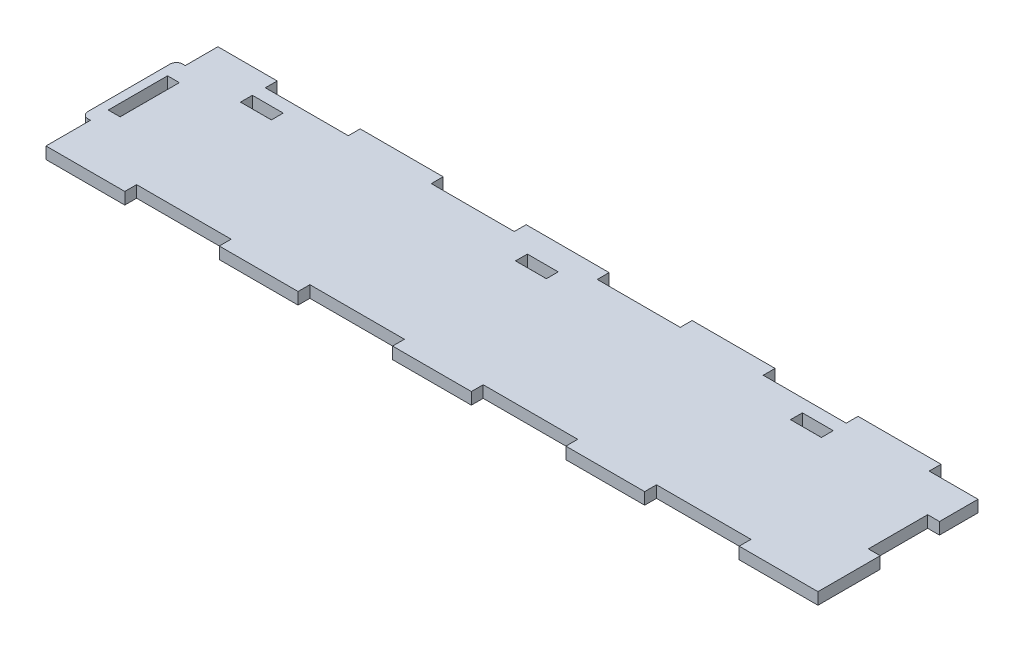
ISO-10303-21;
HEADER;
FILE_DESCRIPTION(('STEP AP214'),'2;1');
FILE_NAME('part.step','',(''),(''),'','','');
FILE_SCHEMA(('AUTOMOTIVE_DESIGN { 1 0 10303 214 1 1 1 1 }'));
ENDSEC;
DATA;
#1=APPLICATION_CONTEXT('core data for automotive mechanical design processes');
#2=APPLICATION_PROTOCOL_DEFINITION('international standard','automotive_design',2000,#1);
#3=PRODUCT_CONTEXT('',#1,'mechanical');
#4=PRODUCT('Part','Part','',(#3));
#5=PRODUCT_RELATED_PRODUCT_CATEGORY('part','',(#4));
#6=PRODUCT_DEFINITION_FORMATION('','',#4);
#7=PRODUCT_DEFINITION_CONTEXT('part definition',#1,'design');
#8=PRODUCT_DEFINITION('design','',#6,#7);
#9=PRODUCT_DEFINITION_SHAPE('','',#8);
#10=(LENGTH_UNIT() NAMED_UNIT(*) SI_UNIT(.MILLI.,.METRE.));
#11=(NAMED_UNIT(*) PLANE_ANGLE_UNIT() SI_UNIT($,.RADIAN.));
#12=(NAMED_UNIT(*) SI_UNIT($,.STERADIAN.) SOLID_ANGLE_UNIT());
#13=UNCERTAINTY_MEASURE_WITH_UNIT(LENGTH_MEASURE(1.E-05),#10,'distance_accuracy_value','');
#14=(GEOMETRIC_REPRESENTATION_CONTEXT(3) GLOBAL_UNCERTAINTY_ASSIGNED_CONTEXT((#13)) GLOBAL_UNIT_ASSIGNED_CONTEXT((#10,
#11,#12)) REPRESENTATION_CONTEXT('',''));
#15=CARTESIAN_POINT('',(0.,0.,0.));
#16=DIRECTION('',(0.,0.,1.));
#17=DIRECTION('',(1.,0.,0.));
#18=AXIS2_PLACEMENT_3D('',#15,#16,#17);
#19=CARTESIAN_POINT('',(-318.446017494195,3.,-92.4431747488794));
#20=DIRECTION('',(0.,-1.,0.));
#21=DIRECTION('',(0.,0.,-1.));
#22=AXIS2_PLACEMENT_3D('',#19,#20,#21);
#23=PLANE('',#22);
#24=DIRECTION('',(0.,0.,1.));
#25=VECTOR('',#24,1.);
#26=CARTESIAN_POINT('',(-163.070917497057,3.,-116.906074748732));
#27=LINE('',#26,#25);
#28=CARTESIAN_POINT('',(-163.070917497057,3.,-116.906074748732));
#29=VERTEX_POINT('',#28);
#30=CARTESIAN_POINT('',(-163.070917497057,3.,-113.896174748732));
#31=VERTEX_POINT('',#30);
#32=EDGE_CURVE('E469',#29,#31,#27,.T.);
#33=ORIENTED_EDGE('',*,*,#32,.F.);
#34=DIRECTION('',(-1.,0.,0.));
#35=VECTOR('',#34,1.);
#36=CARTESIAN_POINT('',(-155.232617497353,3.,-116.906074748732));
#37=LINE('',#36,#35);
#38=CARTESIAN_POINT('',(-155.232617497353,3.,-116.906074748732));
#39=VERTEX_POINT('',#38);
#40=EDGE_CURVE('E477',#39,#29,#37,.T.);
#41=ORIENTED_EDGE('',*,*,#40,.F.);
#42=DIRECTION('',(0.,0.,-1.));
#43=VECTOR('',#42,1.);
#44=CARTESIAN_POINT('',(-155.232617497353,3.,-113.896174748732));
#45=LINE('',#44,#43);
#46=CARTESIAN_POINT('',(-155.232617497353,3.,-113.896174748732));
#47=VERTEX_POINT('',#46);
#48=EDGE_CURVE('E474',#47,#39,#45,.T.);
#49=ORIENTED_EDGE('',*,*,#48,.F.);
#50=DIRECTION('',(1.,0.,0.));
#51=VECTOR('',#50,1.);
#52=CARTESIAN_POINT('',(-163.070917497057,3.,-113.896174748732));
#53=LINE('',#52,#51);
#54=EDGE_CURVE('E471',#31,#47,#53,.T.);
#55=ORIENTED_EDGE('',*,*,#54,.F.);
#56=EDGE_LOOP('',(#33,#41,#49,#55));
#57=FACE_BOUND('',#56,.T.);
#58=DIRECTION('',(1.,0.,0.));
#59=VECTOR('',#58,1.);
#60=CARTESIAN_POINT('',(-314.761917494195,3.,-95.3662747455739));
#61=LINE('',#60,#59);
#62=CARTESIAN_POINT('',(-317.771817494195,3.,-95.3662747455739));
#63=VERTEX_POINT('',#62);
#64=CARTESIAN_POINT('',(-314.761917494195,3.,-95.3662747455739));
#65=VERTEX_POINT('',#64);
#66=EDGE_CURVE('E531',#63,#65,#61,.T.);
#67=ORIENTED_EDGE('',*,*,#66,.F.);
#68=DIRECTION('',(0.,0.,1.));
#69=VECTOR('',#68,1.);
#70=CARTESIAN_POINT('',(-317.771817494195,3.,-95.3662747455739));
#71=LINE('',#70,#69);
#72=CARTESIAN_POINT('',(-317.771817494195,3.,-110.415974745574));
#73=VERTEX_POINT('',#72);
#74=EDGE_CURVE('E539',#73,#63,#71,.T.);
#75=ORIENTED_EDGE('',*,*,#74,.F.);
#76=DIRECTION('',(-1.,0.,0.));
#77=VECTOR('',#76,1.);
#78=CARTESIAN_POINT('',(-317.771817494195,3.,-110.415974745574));
#79=LINE('',#78,#77);
#80=CARTESIAN_POINT('',(-314.761917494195,3.,-110.415974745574));
#81=VERTEX_POINT('',#80);
#82=EDGE_CURVE('E536',#81,#73,#79,.T.);
#83=ORIENTED_EDGE('',*,*,#82,.F.);
#84=DIRECTION('',(0.,0.,-1.));
#85=VECTOR('',#84,1.);
#86=CARTESIAN_POINT('',(-314.761917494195,3.,-110.415974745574));
#87=LINE('',#86,#85);
#88=EDGE_CURVE('E533',#65,#81,#87,.T.);
#89=ORIENTED_EDGE('',*,*,#88,.F.);
#90=EDGE_LOOP('',(#67,#75,#83,#89));
#91=FACE_BOUND('',#90,.T.);
#92=CARTESIAN_POINT('',(-318.446017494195,3.,-92.4431747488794));
#93=DIRECTION('',(0.,1.,0.));
#94=DIRECTION('',(0.,0.,-1.));
#95=AXIS2_PLACEMENT_3D('',#92,#93,#94);
#96=CIRCLE('',#95,1.58330000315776);
#97=CARTESIAN_POINT('',(-320.029317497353,3.,-92.4431747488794));
#98=VERTEX_POINT('',#97);
#99=CARTESIAN_POINT('',(-318.446017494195,3.,-90.8598747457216));
#100=VERTEX_POINT('',#99);
#101=EDGE_CURVE('E562',#98,#100,#96,.T.);
#102=ORIENTED_EDGE('',*,*,#101,.T.);
#103=DIRECTION('',(1.,0.,0.));
#104=VECTOR('',#103,1.);
#105=CARTESIAN_POINT('',(-317.771817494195,3.,-90.8598747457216));
#106=LINE('',#105,#104);
#107=CARTESIAN_POINT('',(-317.771817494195,3.,-90.8598747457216));
#108=VERTEX_POINT('',#107);
#109=EDGE_CURVE('E565',#100,#108,#106,.T.);
#110=ORIENTED_EDGE('',*,*,#109,.T.);
#111=DIRECTION('',(0.,0.,1.));
#112=VECTOR('',#111,1.);
#113=CARTESIAN_POINT('',(-317.771817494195,3.,-79.5636747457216));
#114=LINE('',#113,#112);
#115=CARTESIAN_POINT('',(-317.771817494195,3.,-79.5636747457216));
#116=VERTEX_POINT('',#115);
#117=EDGE_CURVE('E568',#108,#116,#114,.T.);
#118=ORIENTED_EDGE('',*,*,#117,.T.);
#119=DIRECTION('',(1.,0.,0.));
#120=VECTOR('',#119,1.);
#121=CARTESIAN_POINT('',(-317.771817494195,3.,-79.5636747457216));
#122=LINE('',#121,#120);
#123=CARTESIAN_POINT('',(-297.771817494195,3.,-79.5636747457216));
#124=VERTEX_POINT('',#123);
#125=EDGE_CURVE('E570',#116,#124,#122,.T.);
#126=ORIENTED_EDGE('',*,*,#125,.T.);
#127=DIRECTION('',(0.,0.,-1.));
#128=VECTOR('',#127,1.);
#129=CARTESIAN_POINT('',(-297.771817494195,3.,-79.5636747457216));
#130=LINE('',#129,#128);
#131=CARTESIAN_POINT('',(-297.771817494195,3.,-82.5636747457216));
#132=VERTEX_POINT('',#131);
#133=EDGE_CURVE('E572',#124,#132,#130,.T.);
#134=ORIENTED_EDGE('',*,*,#133,.T.);
#135=DIRECTION('',(1.,0.,0.));
#136=VECTOR('',#135,1.);
#137=CARTESIAN_POINT('',(-297.771817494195,3.,-82.5636747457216));
#138=LINE('',#137,#136);
#139=CARTESIAN_POINT('',(-273.771817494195,3.,-82.5636747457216));
#140=VERTEX_POINT('',#139);
#141=EDGE_CURVE('E574',#132,#140,#138,.T.);
#142=ORIENTED_EDGE('',*,*,#141,.T.);
#143=DIRECTION('',(0.,0.,1.));
#144=VECTOR('',#143,1.);
#145=CARTESIAN_POINT('',(-273.771817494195,3.,-82.5636747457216));
#146=LINE('',#145,#144);
#147=CARTESIAN_POINT('',(-273.771817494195,3.,-79.5636747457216));
#148=VERTEX_POINT('',#147);
#149=EDGE_CURVE('E576',#140,#148,#146,.T.);
#150=ORIENTED_EDGE('',*,*,#149,.T.);
#151=DIRECTION('',(1.,0.,0.));
#152=VECTOR('',#151,1.);
#153=CARTESIAN_POINT('',(-273.771817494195,3.,-79.5636747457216));
#154=LINE('',#153,#152);
#155=CARTESIAN_POINT('',(-253.771817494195,3.,-79.5636747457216));
#156=VERTEX_POINT('',#155);
#157=EDGE_CURVE('E578',#148,#156,#154,.T.);
#158=ORIENTED_EDGE('',*,*,#157,.T.);
#159=DIRECTION('',(0.,0.,-1.));
#160=VECTOR('',#159,1.);
#161=CARTESIAN_POINT('',(-253.771817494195,3.,-79.5636747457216));
#162=LINE('',#161,#160);
#163=CARTESIAN_POINT('',(-253.771817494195,3.,-82.5636747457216));
#164=VERTEX_POINT('',#163);
#165=EDGE_CURVE('E580',#156,#164,#162,.T.);
#166=ORIENTED_EDGE('',*,*,#165,.T.);
#167=DIRECTION('',(1.,0.,0.));
#168=VECTOR('',#167,1.);
#169=CARTESIAN_POINT('',(-253.771817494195,3.,-82.5636747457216));
#170=LINE('',#169,#168);
#171=CARTESIAN_POINT('',(-229.771817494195,3.,-82.5636747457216));
#172=VERTEX_POINT('',#171);
#173=EDGE_CURVE('E582',#164,#172,#170,.T.);
#174=ORIENTED_EDGE('',*,*,#173,.T.);
#175=DIRECTION('',(0.,0.,1.));
#176=VECTOR('',#175,1.);
#177=CARTESIAN_POINT('',(-229.771817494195,3.,-82.5636747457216));
#178=LINE('',#177,#176);
#179=CARTESIAN_POINT('',(-229.771817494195,3.,-79.5636747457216));
#180=VERTEX_POINT('',#179);
#181=EDGE_CURVE('E584',#172,#180,#178,.T.);
#182=ORIENTED_EDGE('',*,*,#181,.T.);
#183=DIRECTION('',(1.,0.,0.));
#184=VECTOR('',#183,1.);
#185=CARTESIAN_POINT('',(-229.771817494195,3.,-79.5636747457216));
#186=LINE('',#185,#184);
#187=CARTESIAN_POINT('',(-209.771817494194,3.,-79.5636747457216));
#188=VERTEX_POINT('',#187);
#189=EDGE_CURVE('E586',#180,#188,#186,.T.);
#190=ORIENTED_EDGE('',*,*,#189,.T.);
#191=DIRECTION('',(0.,0.,-1.));
#192=VECTOR('',#191,1.);
#193=CARTESIAN_POINT('',(-209.771817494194,3.,-79.5636747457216));
#194=LINE('',#193,#192);
#195=CARTESIAN_POINT('',(-209.771817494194,3.,-82.5636747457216));
#196=VERTEX_POINT('',#195);
#197=EDGE_CURVE('E588',#188,#196,#194,.T.);
#198=ORIENTED_EDGE('',*,*,#197,.T.);
#199=DIRECTION('',(1.,0.,0.));
#200=VECTOR('',#199,1.);
#201=CARTESIAN_POINT('',(-209.771817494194,3.,-82.5636747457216));
#202=LINE('',#201,#200);
#203=CARTESIAN_POINT('',(-185.771817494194,3.,-82.5636747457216));
#204=VERTEX_POINT('',#203);
#205=EDGE_CURVE('E590',#196,#204,#202,.T.);
#206=ORIENTED_EDGE('',*,*,#205,.T.);
#207=DIRECTION('',(0.,0.,1.));
#208=VECTOR('',#207,1.);
#209=CARTESIAN_POINT('',(-185.771817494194,3.,-82.5636747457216));
#210=LINE('',#209,#208);
#211=CARTESIAN_POINT('',(-185.771817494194,3.,-79.5636747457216));
#212=VERTEX_POINT('',#211);
#213=EDGE_CURVE('E592',#204,#212,#210,.T.);
#214=ORIENTED_EDGE('',*,*,#213,.T.);
#215=DIRECTION('',(1.,0.,0.));
#216=VECTOR('',#215,1.);
#217=CARTESIAN_POINT('',(-185.771817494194,3.,-79.5636747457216));
#218=LINE('',#217,#216);
#219=CARTESIAN_POINT('',(-165.771817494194,3.,-79.5636747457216));
#220=VERTEX_POINT('',#219);
#221=EDGE_CURVE('E594',#212,#220,#218,.T.);
#222=ORIENTED_EDGE('',*,*,#221,.T.);
#223=DIRECTION('',(0.,0.,-1.));
#224=VECTOR('',#223,1.);
#225=CARTESIAN_POINT('',(-165.771817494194,3.,-79.5636747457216));
#226=LINE('',#225,#224);
#227=CARTESIAN_POINT('',(-165.771817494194,3.,-82.5636747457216));
#228=VERTEX_POINT('',#227);
#229=EDGE_CURVE('E596',#220,#228,#226,.T.);
#230=ORIENTED_EDGE('',*,*,#229,.T.);
#231=DIRECTION('',(1.,0.,0.));
#232=VECTOR('',#231,1.);
#233=CARTESIAN_POINT('',(-165.771817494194,3.,-82.5636747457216));
#234=LINE('',#233,#232);
#235=CARTESIAN_POINT('',(-141.771817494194,3.,-82.5636747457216));
#236=VERTEX_POINT('',#235);
#237=EDGE_CURVE('E598',#228,#236,#234,.T.);
#238=ORIENTED_EDGE('',*,*,#237,.T.);
#239=DIRECTION('',(0.,0.,1.));
#240=VECTOR('',#239,1.);
#241=CARTESIAN_POINT('',(-141.771817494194,3.,-82.5636747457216));
#242=LINE('',#241,#240);
#243=CARTESIAN_POINT('',(-141.771817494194,3.,-79.5636747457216));
#244=VERTEX_POINT('',#243);
#245=EDGE_CURVE('E600',#236,#244,#242,.T.);
#246=ORIENTED_EDGE('',*,*,#245,.T.);
#247=DIRECTION('',(1.,0.,0.));
#248=VECTOR('',#247,1.);
#249=CARTESIAN_POINT('',(-141.771817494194,3.,-79.5636747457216));
#250=LINE('',#249,#248);
#251=CARTESIAN_POINT('',(-121.771817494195,3.,-79.5636747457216));
#252=VERTEX_POINT('',#251);
#253=EDGE_CURVE('E602',#244,#252,#250,.T.);
#254=ORIENTED_EDGE('',*,*,#253,.T.);
#255=DIRECTION('',(0.,0.,-1.));
#256=VECTOR('',#255,1.);
#257=CARTESIAN_POINT('',(-121.771817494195,3.,-95.3662747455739));
#258=LINE('',#257,#256);
#259=CARTESIAN_POINT('',(-121.771817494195,3.,-95.3662747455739));
#260=VERTEX_POINT('',#259);
#261=EDGE_CURVE('E604',#252,#260,#258,.T.);
#262=ORIENTED_EDGE('',*,*,#261,.T.);
#263=DIRECTION('',(-1.,0.,0.));
#264=VECTOR('',#263,1.);
#265=CARTESIAN_POINT('',(-124.771817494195,3.,-95.3662747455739));
#266=LINE('',#265,#264);
#267=CARTESIAN_POINT('',(-124.771817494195,3.,-95.3662747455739));
#268=VERTEX_POINT('',#267);
#269=EDGE_CURVE('E606',#260,#268,#266,.T.);
#270=ORIENTED_EDGE('',*,*,#269,.T.);
#271=DIRECTION('',(0.,0.,-1.));
#272=VECTOR('',#271,1.);
#273=CARTESIAN_POINT('',(-124.771817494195,3.,-110.415974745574));
#274=LINE('',#273,#272);
#275=CARTESIAN_POINT('',(-124.771817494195,3.,-110.415974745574));
#276=VERTEX_POINT('',#275);
#277=EDGE_CURVE('E608',#268,#276,#274,.T.);
#278=ORIENTED_EDGE('',*,*,#277,.T.);
#279=DIRECTION('',(1.,0.,0.));
#280=VECTOR('',#279,1.);
#281=CARTESIAN_POINT('',(-124.771817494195,3.,-110.415974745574));
#282=LINE('',#281,#280);
#283=CARTESIAN_POINT('',(-121.771817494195,3.,-110.415974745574));
#284=VERTEX_POINT('',#283);
#285=EDGE_CURVE('E610',#276,#284,#282,.T.);
#286=ORIENTED_EDGE('',*,*,#285,.T.);
#287=DIRECTION('',(0.,0.,-1.));
#288=VECTOR('',#287,1.);
#289=CARTESIAN_POINT('',(-121.771817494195,3.,-110.415974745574));
#290=LINE('',#289,#288);
#291=CARTESIAN_POINT('',(-121.771817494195,3.,-120.19837474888));
#292=VERTEX_POINT('',#291);
#293=EDGE_CURVE('E612',#284,#292,#290,.T.);
#294=ORIENTED_EDGE('',*,*,#293,.T.);
#295=DIRECTION('',(-1.,0.,0.));
#296=VECTOR('',#295,1.);
#297=CARTESIAN_POINT('',(-134.162917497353,3.,-120.19837474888));
#298=LINE('',#297,#296);
#299=CARTESIAN_POINT('',(-134.162917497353,3.,-120.19837474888));
#300=VERTEX_POINT('',#299);
#301=EDGE_CURVE('E614',#292,#300,#298,.T.);
#302=ORIENTED_EDGE('',*,*,#301,.T.);
#303=DIRECTION('',(-3.32226458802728E-05,0.,-0.999999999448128));
#304=VECTOR('',#303,1.);
#305=CARTESIAN_POINT('',(-134.163017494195,3.,-123.20827474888));
#306=LINE('',#305,#304);
#307=CARTESIAN_POINT('',(-134.163017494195,3.,-123.20827474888));
#308=VERTEX_POINT('',#307);
#309=EDGE_CURVE('E616',#300,#308,#306,.T.);
#310=ORIENTED_EDGE('',*,*,#309,.T.);
#311=DIRECTION('',(-1.,0.,0.));
#312=VECTOR('',#311,1.);
#313=CARTESIAN_POINT('',(-155.232617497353,3.,-123.208274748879));
#314=LINE('',#313,#312);
#315=CARTESIAN_POINT('',(-155.232617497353,3.,-123.208274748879));
#316=VERTEX_POINT('',#315);
#317=EDGE_CURVE('E618',#308,#316,#314,.T.);
#318=ORIENTED_EDGE('',*,*,#317,.T.);
#319=DIRECTION('',(0.,0.,1.));
#320=VECTOR('',#319,1.);
#321=CARTESIAN_POINT('',(-155.232617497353,3.,-123.208274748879));
#322=LINE('',#321,#320);
#323=CARTESIAN_POINT('',(-155.232617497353,3.,-120.19837474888));
#324=VERTEX_POINT('',#323);
#325=EDGE_CURVE('E620',#316,#324,#322,.T.);
#326=ORIENTED_EDGE('',*,*,#325,.T.);
#327=DIRECTION('',(-1.,0.,0.));
#328=VECTOR('',#327,1.);
#329=CARTESIAN_POINT('',(-155.232617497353,3.,-120.19837474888));
#330=LINE('',#329,#328);
#331=CARTESIAN_POINT('',(-176.302617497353,3.,-120.19837474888));
#332=VERTEX_POINT('',#331);
#333=EDGE_CURVE('E622',#324,#332,#330,.T.);
#334=ORIENTED_EDGE('',*,*,#333,.T.);
#335=DIRECTION('',(0.,0.,-1.));
#336=VECTOR('',#335,1.);
#337=CARTESIAN_POINT('',(-176.302617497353,3.,-120.19837474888));
#338=LINE('',#337,#336);
#339=CARTESIAN_POINT('',(-176.302617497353,3.,-123.208274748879));
#340=VERTEX_POINT('',#339);
#341=EDGE_CURVE('E624',#332,#340,#338,.T.);
#342=ORIENTED_EDGE('',*,*,#341,.T.);
#343=DIRECTION('',(-1.,0.,0.));
#344=VECTOR('',#343,1.);
#345=CARTESIAN_POINT('',(-176.302617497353,3.,-123.208274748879));
#346=LINE('',#345,#344);
#347=CARTESIAN_POINT('',(-197.372317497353,3.,-123.208274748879));
#348=VERTEX_POINT('',#347);
#349=EDGE_CURVE('E626',#340,#348,#346,.T.);
#350=ORIENTED_EDGE('',*,*,#349,.T.);
#351=DIRECTION('',(0.,0.,1.));
#352=VECTOR('',#351,1.);
#353=CARTESIAN_POINT('',(-197.372317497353,3.,-123.208274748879));
#354=LINE('',#353,#352);
#355=CARTESIAN_POINT('',(-197.372317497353,3.,-120.19837474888));
#356=VERTEX_POINT('',#355);
#357=EDGE_CURVE('E628',#348,#356,#354,.T.);
#358=ORIENTED_EDGE('',*,*,#357,.T.);
#359=DIRECTION('',(-1.,0.,0.));
#360=VECTOR('',#359,1.);
#361=CARTESIAN_POINT('',(-197.372317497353,3.,-120.19837474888));
#362=LINE('',#361,#360);
#363=CARTESIAN_POINT('',(-218.442417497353,3.,-120.19837474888));
#364=VERTEX_POINT('',#363);
#365=EDGE_CURVE('E630',#356,#364,#362,.T.);
#366=ORIENTED_EDGE('',*,*,#365,.T.);
#367=DIRECTION('',(0.,0.,-1.));
#368=VECTOR('',#367,1.);
#369=CARTESIAN_POINT('',(-218.442417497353,3.,-120.19837474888));
#370=LINE('',#369,#368);
#371=CARTESIAN_POINT('',(-218.442417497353,3.,-123.208274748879));
#372=VERTEX_POINT('',#371);
#373=EDGE_CURVE('E632',#364,#372,#370,.T.);
#374=ORIENTED_EDGE('',*,*,#373,.T.);
#375=DIRECTION('',(-1.,0.,0.));
#376=VECTOR('',#375,1.);
#377=CARTESIAN_POINT('',(-218.442417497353,3.,-123.208274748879));
#378=LINE('',#377,#376);
#379=CARTESIAN_POINT('',(-239.512117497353,3.,-123.208274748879));
#380=VERTEX_POINT('',#379);
#381=EDGE_CURVE('E634',#372,#380,#378,.T.);
#382=ORIENTED_EDGE('',*,*,#381,.T.);
#383=DIRECTION('',(0.,0.,1.));
#384=VECTOR('',#383,1.);
#385=CARTESIAN_POINT('',(-239.512117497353,3.,-123.208274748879));
#386=LINE('',#385,#384);
#387=CARTESIAN_POINT('',(-239.512117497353,3.,-120.19837474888));
#388=VERTEX_POINT('',#387);
#389=EDGE_CURVE('E636',#380,#388,#386,.T.);
#390=ORIENTED_EDGE('',*,*,#389,.T.);
#391=DIRECTION('',(-1.,0.,0.));
#392=VECTOR('',#391,1.);
#393=CARTESIAN_POINT('',(-239.512117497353,3.,-120.19837474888));
#394=LINE('',#393,#392);
#395=CARTESIAN_POINT('',(-260.582017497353,3.,-120.19837474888));
#396=VERTEX_POINT('',#395);
#397=EDGE_CURVE('E638',#388,#396,#394,.T.);
#398=ORIENTED_EDGE('',*,*,#397,.T.);
#399=DIRECTION('',(0.,0.,-1.));
#400=VECTOR('',#399,1.);
#401=CARTESIAN_POINT('',(-260.582017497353,3.,-120.19837474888));
#402=LINE('',#401,#400);
#403=CARTESIAN_POINT('',(-260.582017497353,3.,-123.208274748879));
#404=VERTEX_POINT('',#403);
#405=EDGE_CURVE('E640',#396,#404,#402,.T.);
#406=ORIENTED_EDGE('',*,*,#405,.T.);
#407=DIRECTION('',(-1.,0.,0.));
#408=VECTOR('',#407,1.);
#409=CARTESIAN_POINT('',(-260.582017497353,3.,-123.208274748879));
#410=LINE('',#409,#408);
#411=CARTESIAN_POINT('',(-281.652017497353,3.,-123.208274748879));
#412=VERTEX_POINT('',#411);
#413=EDGE_CURVE('E642',#404,#412,#410,.T.);
#414=ORIENTED_EDGE('',*,*,#413,.T.);
#415=DIRECTION('',(0.,0.,1.));
#416=VECTOR('',#415,1.);
#417=CARTESIAN_POINT('',(-281.652017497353,3.,-123.208274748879));
#418=LINE('',#417,#416);
#419=CARTESIAN_POINT('',(-281.652017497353,3.,-120.19837474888));
#420=VERTEX_POINT('',#419);
#421=EDGE_CURVE('E644',#412,#420,#418,.T.);
#422=ORIENTED_EDGE('',*,*,#421,.T.);
#423=DIRECTION('',(-1.,0.,0.));
#424=VECTOR('',#423,1.);
#425=CARTESIAN_POINT('',(-281.652017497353,3.,-120.19837474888));
#426=LINE('',#425,#424);
#427=CARTESIAN_POINT('',(-302.721817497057,3.,-120.19837474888));
#428=VERTEX_POINT('',#427);
#429=EDGE_CURVE('E646',#420,#428,#426,.T.);
#430=ORIENTED_EDGE('',*,*,#429,.T.);
#431=DIRECTION('',(0.,0.,-1.));
#432=VECTOR('',#431,1.);
#433=CARTESIAN_POINT('',(-302.721817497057,3.,-120.19837474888));
#434=LINE('',#433,#432);
#435=CARTESIAN_POINT('',(-302.721817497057,3.,-123.208274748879));
#436=VERTEX_POINT('',#435);
#437=EDGE_CURVE('E648',#428,#436,#434,.T.);
#438=ORIENTED_EDGE('',*,*,#437,.T.);
#439=DIRECTION('',(-1.,0.,0.));
#440=VECTOR('',#439,1.);
#441=CARTESIAN_POINT('',(-302.721817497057,3.,-123.208274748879));
#442=LINE('',#441,#440);
#443=CARTESIAN_POINT('',(-317.771817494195,3.,-123.208274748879));
#444=VERTEX_POINT('',#443);
#445=EDGE_CURVE('E650',#436,#444,#442,.T.);
#446=ORIENTED_EDGE('',*,*,#445,.T.);
#447=DIRECTION('',(0.,0.,1.));
#448=VECTOR('',#447,1.);
#449=CARTESIAN_POINT('',(-317.771817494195,3.,-114.922174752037));
#450=LINE('',#449,#448);
#451=CARTESIAN_POINT('',(-317.771817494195,3.,-114.922174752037));
#452=VERTEX_POINT('',#451);
#453=EDGE_CURVE('E652',#444,#452,#450,.T.);
#454=ORIENTED_EDGE('',*,*,#453,.T.);
#455=DIRECTION('',(-1.,0.,0.));
#456=VECTOR('',#455,1.);
#457=CARTESIAN_POINT('',(-318.446017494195,3.,-114.922174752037));
#458=LINE('',#457,#456);
#459=CARTESIAN_POINT('',(-318.446017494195,3.,-114.922174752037));
#460=VERTEX_POINT('',#459);
#461=EDGE_CURVE('E654',#452,#460,#458,.T.);
#462=ORIENTED_EDGE('',*,*,#461,.T.);
#463=CARTESIAN_POINT('',(-318.446017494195,3.,-113.338874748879));
#464=DIRECTION('',(0.,1.,0.));
#465=DIRECTION('',(0.,0.,-1.));
#466=AXIS2_PLACEMENT_3D('',#463,#464,#465);
#467=CIRCLE('',#466,1.58330000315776);
#468=CARTESIAN_POINT('',(-320.029317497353,3.,-113.338874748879));
#469=VERTEX_POINT('',#468);
#470=EDGE_CURVE('E656',#460,#469,#467,.T.);
#471=ORIENTED_EDGE('',*,*,#470,.T.);
#472=DIRECTION('',(0.,0.,1.));
#473=VECTOR('',#472,1.);
#474=CARTESIAN_POINT('',(-320.029317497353,3.,-92.4431747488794));
#475=LINE('',#474,#473);
#476=EDGE_CURVE('E658',#469,#98,#475,.T.);
#477=ORIENTED_EDGE('',*,*,#476,.T.);
#478=EDGE_LOOP('',(#102,#110,#118,#126,#134,#142,#150,#158,#166,#174,#182,#190,#198,#206,#214,
#222,#230,#238,#246,#254,#262,#270,#278,#286,#294,#302,#310,#318,#326,#334,#342,#350,#358,#366,
#374,#382,#390,#398,#406,#414,#422,#430,#438,#446,#454,#462,#471,#477));
#479=FACE_BOUND('',#478,.T.);
#480=DIRECTION('',(0.,0.,1.));
#481=VECTOR('',#480,1.);
#482=CARTESIAN_POINT('',(-302.721817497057,3.,-116.906074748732));
#483=LINE('',#482,#481);
#484=CARTESIAN_POINT('',(-302.721817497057,3.,-116.906074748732));
#485=VERTEX_POINT('',#484);
#486=CARTESIAN_POINT('',(-302.721817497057,3.,-113.896174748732));
#487=VERTEX_POINT('',#486);
#488=EDGE_CURVE('E500',#485,#487,#483,.T.);
#489=ORIENTED_EDGE('',*,*,#488,.F.);
#490=DIRECTION('',(-1.,0.,0.));
#491=VECTOR('',#490,1.);
#492=CARTESIAN_POINT('',(-294.883417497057,3.,-116.906074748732));
#493=LINE('',#492,#491);
#494=CARTESIAN_POINT('',(-294.883417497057,3.,-116.906074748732));
#495=VERTEX_POINT('',#494);
#496=EDGE_CURVE('E508',#495,#485,#493,.T.);
#497=ORIENTED_EDGE('',*,*,#496,.F.);
#498=DIRECTION('',(0.,0.,-1.));
#499=VECTOR('',#498,1.);
#500=CARTESIAN_POINT('',(-294.883417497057,3.,-113.896174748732));
#501=LINE('',#500,#499);
#502=CARTESIAN_POINT('',(-294.883417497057,3.,-113.896174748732));
#503=VERTEX_POINT('',#502);
#504=EDGE_CURVE('E505',#503,#495,#501,.T.);
#505=ORIENTED_EDGE('',*,*,#504,.F.);
#506=DIRECTION('',(1.,0.,0.));
#507=VECTOR('',#506,1.);
#508=CARTESIAN_POINT('',(-302.721817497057,3.,-113.896174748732));
#509=LINE('',#508,#507);
#510=EDGE_CURVE('E502',#487,#503,#509,.T.);
#511=ORIENTED_EDGE('',*,*,#510,.F.);
#512=EDGE_LOOP('',(#489,#497,#505,#511));
#513=FACE_BOUND('',#512,.T.);
#514=DIRECTION('',(0.,0.,1.));
#515=VECTOR('',#514,1.);
#516=CARTESIAN_POINT('',(-232.896417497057,3.,-116.906074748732));
#517=LINE('',#516,#515);
#518=CARTESIAN_POINT('',(-232.896417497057,3.,-116.906074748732));
#519=VERTEX_POINT('',#518);
#520=CARTESIAN_POINT('',(-232.896417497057,3.,-113.896174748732));
#521=VERTEX_POINT('',#520);
#522=EDGE_CURVE('E433',#519,#521,#517,.T.);
#523=ORIENTED_EDGE('',*,*,#522,.F.);
#524=DIRECTION('',(-1.,0.,0.));
#525=VECTOR('',#524,1.);
#526=CARTESIAN_POINT('',(-225.058217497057,3.,-116.906074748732));
#527=LINE('',#526,#525);
#528=CARTESIAN_POINT('',(-225.058217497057,3.,-116.906074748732));
#529=VERTEX_POINT('',#528);
#530=EDGE_CURVE('E455',#529,#519,#527,.T.);
#531=ORIENTED_EDGE('',*,*,#530,.F.);
#532=DIRECTION('',(0.,0.,-1.));
#533=VECTOR('',#532,1.);
#534=CARTESIAN_POINT('',(-225.058217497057,3.,-113.896174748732));
#535=LINE('',#534,#533);
#536=CARTESIAN_POINT('',(-225.058217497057,3.,-113.896174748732));
#537=VERTEX_POINT('',#536);
#538=EDGE_CURVE('E453',#537,#529,#535,.T.);
#539=ORIENTED_EDGE('',*,*,#538,.F.);
#540=DIRECTION('',(1.,0.,0.));
#541=VECTOR('',#540,1.);
#542=CARTESIAN_POINT('',(-232.896417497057,3.,-113.896174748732));
#543=LINE('',#542,#541);
#544=EDGE_CURVE('E441',#521,#537,#543,.T.);
#545=ORIENTED_EDGE('',*,*,#544,.F.);
#546=EDGE_LOOP('',(#523,#531,#539,#545));
#547=FACE_BOUND('',#546,.T.);
#548=ADVANCED_FACE('F32',(#57,#91,#479,#513,#547),#23,.F.);
#549=CARTESIAN_POINT('',(-318.446017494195,0.,-92.4431747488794));
#550=DIRECTION('',(0.,-1.,0.));
#551=DIRECTION('',(0.,0.,-1.));
#552=AXIS2_PLACEMENT_3D('',#549,#550,#551);
#553=PLANE('',#552);
#554=CARTESIAN_POINT('',(-318.446017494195,0.,-92.4431747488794));
#555=DIRECTION('',(0.,1.,0.));
#556=DIRECTION('',(0.,0.,-1.));
#557=AXIS2_PLACEMENT_3D('',#554,#555,#556);
#558=CIRCLE('',#557,1.58330000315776);
#559=CARTESIAN_POINT('',(-320.029317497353,0.,-92.4431747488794));
#560=VERTEX_POINT('',#559);
#561=CARTESIAN_POINT('',(-318.446017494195,0.,-90.8598747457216));
#562=VERTEX_POINT('',#561);
#563=EDGE_CURVE('E561',#560,#562,#558,.T.);
#564=ORIENTED_EDGE('',*,*,#563,.F.);
#565=DIRECTION('',(0.,0.,1.));
#566=VECTOR('',#565,1.);
#567=CARTESIAN_POINT('',(-320.029317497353,0.,-92.4431747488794));
#568=LINE('',#567,#566);
#569=CARTESIAN_POINT('',(-320.029317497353,0.,-113.338874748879));
#570=VERTEX_POINT('',#569);
#571=EDGE_CURVE('E566',#570,#560,#568,.T.);
#572=ORIENTED_EDGE('',*,*,#571,.F.);
#573=CARTESIAN_POINT('',(-318.446017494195,0.,-113.338874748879));
#574=DIRECTION('',(0.,1.,0.));
#575=DIRECTION('',(0.,0.,-1.));
#576=AXIS2_PLACEMENT_3D('',#573,#574,#575);
#577=CIRCLE('',#576,1.58330000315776);
#578=CARTESIAN_POINT('',(-318.446017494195,0.,-114.922174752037));
#579=VERTEX_POINT('',#578);
#580=EDGE_CURVE('E754',#579,#570,#577,.T.);
#581=ORIENTED_EDGE('',*,*,#580,.F.);
#582=DIRECTION('',(-1.,0.,0.));
#583=VECTOR('',#582,1.);
#584=CARTESIAN_POINT('',(-318.446017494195,0.,-114.922174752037));
#585=LINE('',#584,#583);
#586=CARTESIAN_POINT('',(-317.771817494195,0.,-114.922174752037));
#587=VERTEX_POINT('',#586);
#588=EDGE_CURVE('E752',#587,#579,#585,.T.);
#589=ORIENTED_EDGE('',*,*,#588,.F.);
#590=DIRECTION('',(0.,0.,1.));
#591=VECTOR('',#590,1.);
#592=CARTESIAN_POINT('',(-317.771817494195,0.,-114.922174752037));
#593=LINE('',#592,#591);
#594=CARTESIAN_POINT('',(-317.771817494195,0.,-123.208274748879));
#595=VERTEX_POINT('',#594);
#596=EDGE_CURVE('E750',#595,#587,#593,.T.);
#597=ORIENTED_EDGE('',*,*,#596,.F.);
#598=DIRECTION('',(-1.,0.,0.));
#599=VECTOR('',#598,1.);
#600=CARTESIAN_POINT('',(-302.721817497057,0.,-123.208274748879));
#601=LINE('',#600,#599);
#602=CARTESIAN_POINT('',(-302.721817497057,0.,-123.208274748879));
#603=VERTEX_POINT('',#602);
#604=EDGE_CURVE('E748',#603,#595,#601,.T.);
#605=ORIENTED_EDGE('',*,*,#604,.F.);
#606=DIRECTION('',(0.,0.,-1.));
#607=VECTOR('',#606,1.);
#608=CARTESIAN_POINT('',(-302.721817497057,0.,-120.19837474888));
#609=LINE('',#608,#607);
#610=CARTESIAN_POINT('',(-302.721817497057,0.,-120.19837474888));
#611=VERTEX_POINT('',#610);
#612=EDGE_CURVE('E746',#611,#603,#609,.T.);
#613=ORIENTED_EDGE('',*,*,#612,.F.);
#614=DIRECTION('',(-1.,0.,0.));
#615=VECTOR('',#614,1.);
#616=CARTESIAN_POINT('',(-281.652017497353,0.,-120.19837474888));
#617=LINE('',#616,#615);
#618=CARTESIAN_POINT('',(-281.652017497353,0.,-120.19837474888));
#619=VERTEX_POINT('',#618);
#620=EDGE_CURVE('E744',#619,#611,#617,.T.);
#621=ORIENTED_EDGE('',*,*,#620,.F.);
#622=DIRECTION('',(0.,0.,1.));
#623=VECTOR('',#622,1.);
#624=CARTESIAN_POINT('',(-281.652017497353,0.,-123.208274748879));
#625=LINE('',#624,#623);
#626=CARTESIAN_POINT('',(-281.652017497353,0.,-123.208274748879));
#627=VERTEX_POINT('',#626);
#628=EDGE_CURVE('E742',#627,#619,#625,.T.);
#629=ORIENTED_EDGE('',*,*,#628,.F.);
#630=DIRECTION('',(-1.,0.,0.));
#631=VECTOR('',#630,1.);
#632=CARTESIAN_POINT('',(-260.582017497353,0.,-123.208274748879));
#633=LINE('',#632,#631);
#634=CARTESIAN_POINT('',(-260.582017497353,0.,-123.208274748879));
#635=VERTEX_POINT('',#634);
#636=EDGE_CURVE('E740',#635,#627,#633,.T.);
#637=ORIENTED_EDGE('',*,*,#636,.F.);
#638=DIRECTION('',(0.,0.,-1.));
#639=VECTOR('',#638,1.);
#640=CARTESIAN_POINT('',(-260.582017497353,0.,-120.19837474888));
#641=LINE('',#640,#639);
#642=CARTESIAN_POINT('',(-260.582017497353,0.,-120.19837474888));
#643=VERTEX_POINT('',#642);
#644=EDGE_CURVE('E738',#643,#635,#641,.T.);
#645=ORIENTED_EDGE('',*,*,#644,.F.);
#646=DIRECTION('',(-1.,0.,0.));
#647=VECTOR('',#646,1.);
#648=CARTESIAN_POINT('',(-239.512117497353,0.,-120.19837474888));
#649=LINE('',#648,#647);
#650=CARTESIAN_POINT('',(-239.512117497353,0.,-120.19837474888));
#651=VERTEX_POINT('',#650);
#652=EDGE_CURVE('E736',#651,#643,#649,.T.);
#653=ORIENTED_EDGE('',*,*,#652,.F.);
#654=DIRECTION('',(0.,0.,1.));
#655=VECTOR('',#654,1.);
#656=CARTESIAN_POINT('',(-239.512117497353,0.,-123.208274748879));
#657=LINE('',#656,#655);
#658=CARTESIAN_POINT('',(-239.512117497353,0.,-123.208274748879));
#659=VERTEX_POINT('',#658);
#660=EDGE_CURVE('E734',#659,#651,#657,.T.);
#661=ORIENTED_EDGE('',*,*,#660,.F.);
#662=DIRECTION('',(-1.,0.,0.));
#663=VECTOR('',#662,1.);
#664=CARTESIAN_POINT('',(-218.442417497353,0.,-123.208274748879));
#665=LINE('',#664,#663);
#666=CARTESIAN_POINT('',(-218.442417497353,0.,-123.208274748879));
#667=VERTEX_POINT('',#666);
#668=EDGE_CURVE('E732',#667,#659,#665,.T.);
#669=ORIENTED_EDGE('',*,*,#668,.F.);
#670=DIRECTION('',(0.,0.,-1.));
#671=VECTOR('',#670,1.);
#672=CARTESIAN_POINT('',(-218.442417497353,0.,-120.19837474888));
#673=LINE('',#672,#671);
#674=CARTESIAN_POINT('',(-218.442417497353,0.,-120.19837474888));
#675=VERTEX_POINT('',#674);
#676=EDGE_CURVE('E730',#675,#667,#673,.T.);
#677=ORIENTED_EDGE('',*,*,#676,.F.);
#678=DIRECTION('',(-1.,0.,0.));
#679=VECTOR('',#678,1.);
#680=CARTESIAN_POINT('',(-197.372317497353,0.,-120.19837474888));
#681=LINE('',#680,#679);
#682=CARTESIAN_POINT('',(-197.372317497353,0.,-120.19837474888));
#683=VERTEX_POINT('',#682);
#684=EDGE_CURVE('E728',#683,#675,#681,.T.);
#685=ORIENTED_EDGE('',*,*,#684,.F.);
#686=DIRECTION('',(0.,0.,1.));
#687=VECTOR('',#686,1.);
#688=CARTESIAN_POINT('',(-197.372317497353,0.,-123.208274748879));
#689=LINE('',#688,#687);
#690=CARTESIAN_POINT('',(-197.372317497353,0.,-123.208274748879));
#691=VERTEX_POINT('',#690);
#692=EDGE_CURVE('E726',#691,#683,#689,.T.);
#693=ORIENTED_EDGE('',*,*,#692,.F.);
#694=DIRECTION('',(-1.,0.,0.));
#695=VECTOR('',#694,1.);
#696=CARTESIAN_POINT('',(-176.302617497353,0.,-123.208274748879));
#697=LINE('',#696,#695);
#698=CARTESIAN_POINT('',(-176.302617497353,0.,-123.208274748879));
#699=VERTEX_POINT('',#698);
#700=EDGE_CURVE('E724',#699,#691,#697,.T.);
#701=ORIENTED_EDGE('',*,*,#700,.F.);
#702=DIRECTION('',(0.,0.,-1.));
#703=VECTOR('',#702,1.);
#704=CARTESIAN_POINT('',(-176.302617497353,0.,-120.19837474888));
#705=LINE('',#704,#703);
#706=CARTESIAN_POINT('',(-176.302617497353,0.,-120.19837474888));
#707=VERTEX_POINT('',#706);
#708=EDGE_CURVE('E722',#707,#699,#705,.T.);
#709=ORIENTED_EDGE('',*,*,#708,.F.);
#710=DIRECTION('',(-1.,0.,0.));
#711=VECTOR('',#710,1.);
#712=CARTESIAN_POINT('',(-155.232617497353,0.,-120.19837474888));
#713=LINE('',#712,#711);
#714=CARTESIAN_POINT('',(-155.232617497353,0.,-120.19837474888));
#715=VERTEX_POINT('',#714);
#716=EDGE_CURVE('E720',#715,#707,#713,.T.);
#717=ORIENTED_EDGE('',*,*,#716,.F.);
#718=DIRECTION('',(0.,0.,1.));
#719=VECTOR('',#718,1.);
#720=CARTESIAN_POINT('',(-155.232617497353,0.,-123.208274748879));
#721=LINE('',#720,#719);
#722=CARTESIAN_POINT('',(-155.232617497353,0.,-123.208274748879));
#723=VERTEX_POINT('',#722);
#724=EDGE_CURVE('E718',#723,#715,#721,.T.);
#725=ORIENTED_EDGE('',*,*,#724,.F.);
#726=DIRECTION('',(-1.,0.,0.));
#727=VECTOR('',#726,1.);
#728=CARTESIAN_POINT('',(-155.232617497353,0.,-123.208274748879));
#729=LINE('',#728,#727);
#730=CARTESIAN_POINT('',(-134.163017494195,0.,-123.20827474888));
#731=VERTEX_POINT('',#730);
#732=EDGE_CURVE('E716',#731,#723,#729,.T.);
#733=ORIENTED_EDGE('',*,*,#732,.F.);
#734=DIRECTION('',(-3.32226458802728E-05,0.,-0.999999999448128));
#735=VECTOR('',#734,1.);
#736=CARTESIAN_POINT('',(-134.163017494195,0.,-123.20827474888));
#737=LINE('',#736,#735);
#738=CARTESIAN_POINT('',(-134.162917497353,0.,-120.19837474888));
#739=VERTEX_POINT('',#738);
#740=EDGE_CURVE('E714',#739,#731,#737,.T.);
#741=ORIENTED_EDGE('',*,*,#740,.F.);
#742=DIRECTION('',(-1.,0.,0.));
#743=VECTOR('',#742,1.);
#744=CARTESIAN_POINT('',(-134.162917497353,0.,-120.19837474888));
#745=LINE('',#744,#743);
#746=CARTESIAN_POINT('',(-121.771817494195,0.,-120.19837474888));
#747=VERTEX_POINT('',#746);
#748=EDGE_CURVE('E712',#747,#739,#745,.T.);
#749=ORIENTED_EDGE('',*,*,#748,.F.);
#750=DIRECTION('',(0.,0.,-1.));
#751=VECTOR('',#750,1.);
#752=CARTESIAN_POINT('',(-121.771817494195,0.,-110.415974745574));
#753=LINE('',#752,#751);
#754=CARTESIAN_POINT('',(-121.771817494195,0.,-110.415974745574));
#755=VERTEX_POINT('',#754);
#756=EDGE_CURVE('E710',#755,#747,#753,.T.);
#757=ORIENTED_EDGE('',*,*,#756,.F.);
#758=DIRECTION('',(1.,0.,0.));
#759=VECTOR('',#758,1.);
#760=CARTESIAN_POINT('',(-124.771817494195,0.,-110.415974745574));
#761=LINE('',#760,#759);
#762=CARTESIAN_POINT('',(-124.771817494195,0.,-110.415974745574));
#763=VERTEX_POINT('',#762);
#764=EDGE_CURVE('E708',#763,#755,#761,.T.);
#765=ORIENTED_EDGE('',*,*,#764,.F.);
#766=DIRECTION('',(0.,0.,-1.));
#767=VECTOR('',#766,1.);
#768=CARTESIAN_POINT('',(-124.771817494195,0.,-110.415974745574));
#769=LINE('',#768,#767);
#770=CARTESIAN_POINT('',(-124.771817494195,0.,-95.3662747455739));
#771=VERTEX_POINT('',#770);
#772=EDGE_CURVE('E706',#771,#763,#769,.T.);
#773=ORIENTED_EDGE('',*,*,#772,.F.);
#774=DIRECTION('',(-1.,0.,0.));
#775=VECTOR('',#774,1.);
#776=CARTESIAN_POINT('',(-124.771817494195,0.,-95.3662747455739));
#777=LINE('',#776,#775);
#778=CARTESIAN_POINT('',(-121.771817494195,0.,-95.3662747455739));
#779=VERTEX_POINT('',#778);
#780=EDGE_CURVE('E704',#779,#771,#777,.T.);
#781=ORIENTED_EDGE('',*,*,#780,.F.);
#782=DIRECTION('',(0.,0.,-1.));
#783=VECTOR('',#782,1.);
#784=CARTESIAN_POINT('',(-121.771817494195,0.,-95.3662747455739));
#785=LINE('',#784,#783);
#786=CARTESIAN_POINT('',(-121.771817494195,0.,-79.5636747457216));
#787=VERTEX_POINT('',#786);
#788=EDGE_CURVE('E702',#787,#779,#785,.T.);
#789=ORIENTED_EDGE('',*,*,#788,.F.);
#790=DIRECTION('',(1.,0.,0.));
#791=VECTOR('',#790,1.);
#792=CARTESIAN_POINT('',(-121.771817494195,0.,-79.5636747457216));
#793=LINE('',#792,#791);
#794=CARTESIAN_POINT('',(-141.771817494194,0.,-79.5636747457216));
#795=VERTEX_POINT('',#794);
#796=EDGE_CURVE('E700',#795,#787,#793,.T.);
#797=ORIENTED_EDGE('',*,*,#796,.F.);
#798=DIRECTION('',(0.,0.,1.));
#799=VECTOR('',#798,1.);
#800=CARTESIAN_POINT('',(-141.771817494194,0.,-82.5636747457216));
#801=LINE('',#800,#799);
#802=CARTESIAN_POINT('',(-141.771817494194,0.,-82.5636747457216));
#803=VERTEX_POINT('',#802);
#804=EDGE_CURVE('E697',#803,#795,#801,.T.);
#805=ORIENTED_EDGE('',*,*,#804,.F.);
#806=DIRECTION('',(1.,0.,0.));
#807=VECTOR('',#806,1.);
#808=CARTESIAN_POINT('',(-165.771817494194,0.,-82.5636747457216));
#809=LINE('',#808,#807);
#810=CARTESIAN_POINT('',(-165.771817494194,0.,-82.5636747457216));
#811=VERTEX_POINT('',#810);
#812=EDGE_CURVE('E695',#811,#803,#809,.T.);
#813=ORIENTED_EDGE('',*,*,#812,.F.);
#814=DIRECTION('',(0.,0.,-1.));
#815=VECTOR('',#814,1.);
#816=CARTESIAN_POINT('',(-165.771817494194,0.,-79.5636747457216));
#817=LINE('',#816,#815);
#818=CARTESIAN_POINT('',(-165.771817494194,0.,-79.5636747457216));
#819=VERTEX_POINT('',#818);
#820=EDGE_CURVE('E693',#819,#811,#817,.T.);
#821=ORIENTED_EDGE('',*,*,#820,.F.);
#822=DIRECTION('',(1.,0.,0.));
#823=VECTOR('',#822,1.);
#824=CARTESIAN_POINT('',(-185.771817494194,0.,-79.5636747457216));
#825=LINE('',#824,#823);
#826=CARTESIAN_POINT('',(-185.771817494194,0.,-79.5636747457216));
#827=VERTEX_POINT('',#826);
#828=EDGE_CURVE('E691',#827,#819,#825,.T.);
#829=ORIENTED_EDGE('',*,*,#828,.F.);
#830=DIRECTION('',(0.,0.,1.));
#831=VECTOR('',#830,1.);
#832=CARTESIAN_POINT('',(-185.771817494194,0.,-82.5636747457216));
#833=LINE('',#832,#831);
#834=CARTESIAN_POINT('',(-185.771817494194,0.,-82.5636747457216));
#835=VERTEX_POINT('',#834);
#836=EDGE_CURVE('E689',#835,#827,#833,.T.);
#837=ORIENTED_EDGE('',*,*,#836,.F.);
#838=DIRECTION('',(1.,0.,0.));
#839=VECTOR('',#838,1.);
#840=CARTESIAN_POINT('',(-209.771817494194,0.,-82.5636747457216));
#841=LINE('',#840,#839);
#842=CARTESIAN_POINT('',(-209.771817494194,0.,-82.5636747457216));
#843=VERTEX_POINT('',#842);
#844=EDGE_CURVE('E687',#843,#835,#841,.T.);
#845=ORIENTED_EDGE('',*,*,#844,.F.);
#846=DIRECTION('',(0.,0.,-1.));
#847=VECTOR('',#846,1.);
#848=CARTESIAN_POINT('',(-209.771817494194,0.,-79.5636747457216));
#849=LINE('',#848,#847);
#850=CARTESIAN_POINT('',(-209.771817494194,0.,-79.5636747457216));
#851=VERTEX_POINT('',#850);
#852=EDGE_CURVE('E685',#851,#843,#849,.T.);
#853=ORIENTED_EDGE('',*,*,#852,.F.);
#854=DIRECTION('',(1.,0.,0.));
#855=VECTOR('',#854,1.);
#856=CARTESIAN_POINT('',(-229.771817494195,0.,-79.5636747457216));
#857=LINE('',#856,#855);
#858=CARTESIAN_POINT('',(-229.771817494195,0.,-79.5636747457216));
#859=VERTEX_POINT('',#858);
#860=EDGE_CURVE('E683',#859,#851,#857,.T.);
#861=ORIENTED_EDGE('',*,*,#860,.F.);
#862=DIRECTION('',(0.,0.,1.));
#863=VECTOR('',#862,1.);
#864=CARTESIAN_POINT('',(-229.771817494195,0.,-82.5636747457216));
#865=LINE('',#864,#863);
#866=CARTESIAN_POINT('',(-229.771817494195,0.,-82.5636747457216));
#867=VERTEX_POINT('',#866);
#868=EDGE_CURVE('E681',#867,#859,#865,.T.);
#869=ORIENTED_EDGE('',*,*,#868,.F.);
#870=DIRECTION('',(1.,0.,0.));
#871=VECTOR('',#870,1.);
#872=CARTESIAN_POINT('',(-253.771817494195,0.,-82.5636747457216));
#873=LINE('',#872,#871);
#874=CARTESIAN_POINT('',(-253.771817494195,0.,-82.5636747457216));
#875=VERTEX_POINT('',#874);
#876=EDGE_CURVE('E679',#875,#867,#873,.T.);
#877=ORIENTED_EDGE('',*,*,#876,.F.);
#878=DIRECTION('',(0.,0.,-1.));
#879=VECTOR('',#878,1.);
#880=CARTESIAN_POINT('',(-253.771817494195,0.,-79.5636747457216));
#881=LINE('',#880,#879);
#882=CARTESIAN_POINT('',(-253.771817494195,0.,-79.5636747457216));
#883=VERTEX_POINT('',#882);
#884=EDGE_CURVE('E677',#883,#875,#881,.T.);
#885=ORIENTED_EDGE('',*,*,#884,.F.);
#886=DIRECTION('',(1.,0.,0.));
#887=VECTOR('',#886,1.);
#888=CARTESIAN_POINT('',(-273.771817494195,0.,-79.5636747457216));
#889=LINE('',#888,#887);
#890=CARTESIAN_POINT('',(-273.771817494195,0.,-79.5636747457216));
#891=VERTEX_POINT('',#890);
#892=EDGE_CURVE('E675',#891,#883,#889,.T.);
#893=ORIENTED_EDGE('',*,*,#892,.F.);
#894=DIRECTION('',(0.,0.,1.));
#895=VECTOR('',#894,1.);
#896=CARTESIAN_POINT('',(-273.771817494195,0.,-82.5636747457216));
#897=LINE('',#896,#895);
#898=CARTESIAN_POINT('',(-273.771817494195,0.,-82.5636747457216));
#899=VERTEX_POINT('',#898);
#900=EDGE_CURVE('E673',#899,#891,#897,.T.);
#901=ORIENTED_EDGE('',*,*,#900,.F.);
#902=DIRECTION('',(1.,0.,0.));
#903=VECTOR('',#902,1.);
#904=CARTESIAN_POINT('',(-297.771817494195,0.,-82.5636747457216));
#905=LINE('',#904,#903);
#906=CARTESIAN_POINT('',(-297.771817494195,0.,-82.5636747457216));
#907=VERTEX_POINT('',#906);
#908=EDGE_CURVE('E671',#907,#899,#905,.T.);
#909=ORIENTED_EDGE('',*,*,#908,.F.);
#910=DIRECTION('',(0.,0.,-1.));
#911=VECTOR('',#910,1.);
#912=CARTESIAN_POINT('',(-297.771817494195,0.,-79.5636747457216));
#913=LINE('',#912,#911);
#914=CARTESIAN_POINT('',(-297.771817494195,0.,-79.5636747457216));
#915=VERTEX_POINT('',#914);
#916=EDGE_CURVE('E669',#915,#907,#913,.T.);
#917=ORIENTED_EDGE('',*,*,#916,.F.);
#918=DIRECTION('',(1.,0.,0.));
#919=VECTOR('',#918,1.);
#920=CARTESIAN_POINT('',(-317.771817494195,0.,-79.5636747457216));
#921=LINE('',#920,#919);
#922=CARTESIAN_POINT('',(-317.771817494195,0.,-79.5636747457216));
#923=VERTEX_POINT('',#922);
#924=EDGE_CURVE('E667',#923,#915,#921,.T.);
#925=ORIENTED_EDGE('',*,*,#924,.F.);
#926=DIRECTION('',(0.,0.,1.));
#927=VECTOR('',#926,1.);
#928=CARTESIAN_POINT('',(-317.771817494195,0.,-79.5636747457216));
#929=LINE('',#928,#927);
#930=CARTESIAN_POINT('',(-317.771817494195,0.,-90.8598747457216));
#931=VERTEX_POINT('',#930);
#932=EDGE_CURVE('E665',#931,#923,#929,.T.);
#933=ORIENTED_EDGE('',*,*,#932,.F.);
#934=DIRECTION('',(1.,0.,0.));
#935=VECTOR('',#934,1.);
#936=CARTESIAN_POINT('',(-317.771817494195,0.,-90.8598747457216));
#937=LINE('',#936,#935);
#938=EDGE_CURVE('E663',#562,#931,#937,.T.);
#939=ORIENTED_EDGE('',*,*,#938,.F.);
#940=EDGE_LOOP('',(#564,#572,#581,#589,#597,#605,#613,#621,#629,#637,#645,#653,#661,#669,#677,
#685,#693,#701,#709,#717,#725,#733,#741,#749,#757,#765,#773,#781,#789,#797,#805,#813,#821,#829,
#837,#845,#853,#861,#869,#877,#885,#893,#901,#909,#917,#925,#933,#939));
#941=FACE_BOUND('',#940,.T.);
#942=DIRECTION('',(0.,0.,1.));
#943=VECTOR('',#942,1.);
#944=CARTESIAN_POINT('',(-317.771817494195,0.,-95.3662747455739));
#945=LINE('',#944,#943);
#946=CARTESIAN_POINT('',(-317.771817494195,0.,-110.415974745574));
#947=VERTEX_POINT('',#946);
#948=CARTESIAN_POINT('',(-317.771817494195,0.,-95.3662747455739));
#949=VERTEX_POINT('',#948);
#950=EDGE_CURVE('E534',#947,#949,#945,.T.);
#951=ORIENTED_EDGE('',*,*,#950,.T.);
#952=DIRECTION('',(1.,0.,0.));
#953=VECTOR('',#952,1.);
#954=CARTESIAN_POINT('',(-314.761917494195,0.,-95.3662747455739));
#955=LINE('',#954,#953);
#956=CARTESIAN_POINT('',(-314.761917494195,0.,-95.3662747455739));
#957=VERTEX_POINT('',#956);
#958=EDGE_CURVE('E530',#949,#957,#955,.T.);
#959=ORIENTED_EDGE('',*,*,#958,.T.);
#960=DIRECTION('',(0.,0.,-1.));
#961=VECTOR('',#960,1.);
#962=CARTESIAN_POINT('',(-314.761917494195,0.,-110.415974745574));
#963=LINE('',#962,#961);
#964=CARTESIAN_POINT('',(-314.761917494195,0.,-110.415974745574));
#965=VERTEX_POINT('',#964);
#966=EDGE_CURVE('E544',#957,#965,#963,.T.);
#967=ORIENTED_EDGE('',*,*,#966,.T.);
#968=DIRECTION('',(-1.,0.,0.));
#969=VECTOR('',#968,1.);
#970=CARTESIAN_POINT('',(-317.771817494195,0.,-110.415974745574));
#971=LINE('',#970,#969);
#972=EDGE_CURVE('E547',#965,#947,#971,.T.);
#973=ORIENTED_EDGE('',*,*,#972,.T.);
#974=EDGE_LOOP('',(#951,#959,#967,#973));
#975=FACE_BOUND('',#974,.T.);
#976=DIRECTION('',(-1.,0.,0.));
#977=VECTOR('',#976,1.);
#978=CARTESIAN_POINT('',(-294.883417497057,0.,-116.906074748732));
#979=LINE('',#978,#977);
#980=CARTESIAN_POINT('',(-294.883417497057,0.,-116.906074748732));
#981=VERTEX_POINT('',#980);
#982=CARTESIAN_POINT('',(-302.721817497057,0.,-116.906074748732));
#983=VERTEX_POINT('',#982);
#984=EDGE_CURVE('E503',#981,#983,#979,.T.);
#985=ORIENTED_EDGE('',*,*,#984,.T.);
#986=DIRECTION('',(0.,0.,1.));
#987=VECTOR('',#986,1.);
#988=CARTESIAN_POINT('',(-302.721817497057,0.,-116.906074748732));
#989=LINE('',#988,#987);
#990=CARTESIAN_POINT('',(-302.721817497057,0.,-113.896174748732));
#991=VERTEX_POINT('',#990);
#992=EDGE_CURVE('E499',#983,#991,#989,.T.);
#993=ORIENTED_EDGE('',*,*,#992,.T.);
#994=DIRECTION('',(1.,0.,0.));
#995=VECTOR('',#994,1.);
#996=CARTESIAN_POINT('',(-302.721817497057,0.,-113.896174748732));
#997=LINE('',#996,#995);
#998=CARTESIAN_POINT('',(-294.883417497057,0.,-113.896174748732));
#999=VERTEX_POINT('',#998);
#1000=EDGE_CURVE('E513',#991,#999,#997,.T.);
#1001=ORIENTED_EDGE('',*,*,#1000,.T.);
#1002=DIRECTION('',(0.,0.,-1.));
#1003=VECTOR('',#1002,1.);
#1004=CARTESIAN_POINT('',(-294.883417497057,0.,-113.896174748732));
#1005=LINE('',#1004,#1003);
#1006=EDGE_CURVE('E516',#999,#981,#1005,.T.);
#1007=ORIENTED_EDGE('',*,*,#1006,.T.);
#1008=EDGE_LOOP('',(#985,#993,#1001,#1007));
#1009=FACE_BOUND('',#1008,.T.);
#1010=DIRECTION('',(-1.,0.,0.));
#1011=VECTOR('',#1010,1.);
#1012=CARTESIAN_POINT('',(-155.232617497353,0.,-116.906074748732));
#1013=LINE('',#1012,#1011);
#1014=CARTESIAN_POINT('',(-155.232617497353,0.,-116.906074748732));
#1015=VERTEX_POINT('',#1014);
#1016=CARTESIAN_POINT('',(-163.070917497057,0.,-116.906074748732));
#1017=VERTEX_POINT('',#1016);
#1018=EDGE_CURVE('E472',#1015,#1017,#1013,.T.);
#1019=ORIENTED_EDGE('',*,*,#1018,.T.);
#1020=DIRECTION('',(0.,0.,1.));
#1021=VECTOR('',#1020,1.);
#1022=CARTESIAN_POINT('',(-163.070917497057,0.,-116.906074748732));
#1023=LINE('',#1022,#1021);
#1024=CARTESIAN_POINT('',(-163.070917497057,0.,-113.896174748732));
#1025=VERTEX_POINT('',#1024);
#1026=EDGE_CURVE('E449',#1017,#1025,#1023,.T.);
#1027=ORIENTED_EDGE('',*,*,#1026,.T.);
#1028=DIRECTION('',(1.,0.,0.));
#1029=VECTOR('',#1028,1.);
#1030=CARTESIAN_POINT('',(-163.070917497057,0.,-113.896174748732));
#1031=LINE('',#1030,#1029);
#1032=CARTESIAN_POINT('',(-155.232617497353,0.,-113.896174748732));
#1033=VERTEX_POINT('',#1032);
#1034=EDGE_CURVE('E482',#1025,#1033,#1031,.T.);
#1035=ORIENTED_EDGE('',*,*,#1034,.T.);
#1036=DIRECTION('',(0.,0.,-1.));
#1037=VECTOR('',#1036,1.);
#1038=CARTESIAN_POINT('',(-155.232617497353,0.,-113.896174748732));
#1039=LINE('',#1038,#1037);
#1040=EDGE_CURVE('E485',#1033,#1015,#1039,.T.);
#1041=ORIENTED_EDGE('',*,*,#1040,.T.);
#1042=EDGE_LOOP('',(#1019,#1027,#1035,#1041));
#1043=FACE_BOUND('',#1042,.T.);
#1044=DIRECTION('',(-1.,0.,0.));
#1045=VECTOR('',#1044,1.);
#1046=CARTESIAN_POINT('',(-225.058217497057,0.,-116.906074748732));
#1047=LINE('',#1046,#1045);
#1048=CARTESIAN_POINT('',(-225.058217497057,0.,-116.906074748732));
#1049=VERTEX_POINT('',#1048);
#1050=CARTESIAN_POINT('',(-232.896417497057,0.,-116.906074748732));
#1051=VERTEX_POINT('',#1050);
#1052=EDGE_CURVE('E442',#1049,#1051,#1047,.T.);
#1053=ORIENTED_EDGE('',*,*,#1052,.T.);
#1054=DIRECTION('',(0.,0.,1.));
#1055=VECTOR('',#1054,1.);
#1056=CARTESIAN_POINT('',(-232.896417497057,0.,-116.906074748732));
#1057=LINE('',#1056,#1055);
#1058=CARTESIAN_POINT('',(-232.896417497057,0.,-113.896174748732));
#1059=VERTEX_POINT('',#1058);
#1060=EDGE_CURVE('E55',#1051,#1059,#1057,.T.);
#1061=ORIENTED_EDGE('',*,*,#1060,.T.);
#1062=DIRECTION('',(1.,0.,0.));
#1063=VECTOR('',#1062,1.);
#1064=CARTESIAN_POINT('',(-232.896417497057,0.,-113.896174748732));
#1065=LINE('',#1064,#1063);
#1066=CARTESIAN_POINT('',(-225.058217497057,0.,-113.896174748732));
#1067=VERTEX_POINT('',#1066);
#1068=EDGE_CURVE('E448',#1059,#1067,#1065,.T.);
#1069=ORIENTED_EDGE('',*,*,#1068,.T.);
#1070=DIRECTION('',(0.,0.,-1.));
#1071=VECTOR('',#1070,1.);
#1072=CARTESIAN_POINT('',(-225.058217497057,0.,-113.896174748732));
#1073=LINE('',#1072,#1071);
#1074=EDGE_CURVE('E461',#1067,#1049,#1073,.T.);
#1075=ORIENTED_EDGE('',*,*,#1074,.T.);
#1076=EDGE_LOOP('',(#1053,#1061,#1069,#1075));
#1077=FACE_BOUND('',#1076,.T.);
#1078=ADVANCED_FACE('F904',(#941,#975,#1009,#1043,#1077),#553,.T.);
#1079=CARTESIAN_POINT('',(-318.446017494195,3.,-92.4431747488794));
#1080=DIRECTION('',(0.,-1.,0.));
#1081=DIRECTION('',(0.,0.,-1.));
#1082=AXIS2_PLACEMENT_3D('',#1079,#1080,#1081);
#1083=CYLINDRICAL_SURFACE('',#1082,1.58330000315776);
#1084=ORIENTED_EDGE('',*,*,#563,.T.);
#1085=DIRECTION('',(0.,-1.,0.));
#1086=VECTOR('',#1085,1.);
#1087=CARTESIAN_POINT('',(-318.446017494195,3.,-90.8598747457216));
#1088=LINE('',#1087,#1086);
#1089=EDGE_CURVE('E11',#100,#562,#1088,.T.);
#1090=ORIENTED_EDGE('',*,*,#1089,.F.);
#1091=ORIENTED_EDGE('',*,*,#101,.F.);
#1092=DIRECTION('',(0.,-1.,0.));
#1093=VECTOR('',#1092,1.);
#1094=CARTESIAN_POINT('',(-320.029317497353,3.,-92.4431747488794));
#1095=LINE('',#1094,#1093);
#1096=EDGE_CURVE('E660',#98,#560,#1095,.T.);
#1097=ORIENTED_EDGE('',*,*,#1096,.T.);
#1098=EDGE_LOOP('',(#1084,#1090,#1091,#1097));
#1099=FACE_BOUND('',#1098,.T.);
#1100=ADVANCED_FACE('F34',(#1099),#1083,.T.);
#1101=CARTESIAN_POINT('',(-317.771817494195,3.,-90.8598747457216));
#1102=DIRECTION('',(0.,0.,-1.));
#1103=DIRECTION('',(-1.,0.,0.));
#1104=AXIS2_PLACEMENT_3D('',#1101,#1102,#1103);
#1105=PLANE('',#1104);
#1106=ORIENTED_EDGE('',*,*,#938,.T.);
#1107=DIRECTION('',(0.,-1.,0.));
#1108=VECTOR('',#1107,1.);
#1109=CARTESIAN_POINT('',(-317.771817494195,3.,-90.8598747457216));
#1110=LINE('',#1109,#1108);
#1111=EDGE_CURVE('E40',#108,#931,#1110,.T.);
#1112=ORIENTED_EDGE('',*,*,#1111,.F.);
#1113=ORIENTED_EDGE('',*,*,#109,.F.);
#1114=ORIENTED_EDGE('',*,*,#1089,.T.);
#1115=EDGE_LOOP('',(#1106,#1112,#1113,#1114));
#1116=FACE_BOUND('',#1115,.T.);
#1117=ADVANCED_FACE('F922',(#1116),#1105,.F.);
#1118=CARTESIAN_POINT('',(-317.771817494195,3.,-79.5636747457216));
#1119=DIRECTION('',(1.,0.,0.));
#1120=DIRECTION('',(0.,0.,-1.));
#1121=AXIS2_PLACEMENT_3D('',#1118,#1119,#1120);
#1122=PLANE('',#1121);
#1123=ORIENTED_EDGE('',*,*,#932,.T.);
#1124=DIRECTION('',(0.,-1.,0.));
#1125=VECTOR('',#1124,1.);
#1126=CARTESIAN_POINT('',(-317.771817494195,3.,-79.5636747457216));
#1127=LINE('',#1126,#1125);
#1128=EDGE_CURVE('E891',#116,#923,#1127,.T.);
#1129=ORIENTED_EDGE('',*,*,#1128,.F.);
#1130=ORIENTED_EDGE('',*,*,#117,.F.);
#1131=ORIENTED_EDGE('',*,*,#1111,.T.);
#1132=EDGE_LOOP('',(#1123,#1129,#1130,#1131));
#1133=FACE_BOUND('',#1132,.T.);
#1134=ADVANCED_FACE('F898',(#1133),#1122,.F.);
#1135=CARTESIAN_POINT('',(-317.771817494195,3.,-79.5636747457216));
#1136=DIRECTION('',(0.,0.,-1.));
#1137=DIRECTION('',(-1.,0.,0.));
#1138=AXIS2_PLACEMENT_3D('',#1135,#1136,#1137);
#1139=PLANE('',#1138);
#1140=ORIENTED_EDGE('',*,*,#924,.T.);
#1141=DIRECTION('',(0.,-1.,0.));
#1142=VECTOR('',#1141,1.);
#1143=CARTESIAN_POINT('',(-297.771817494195,3.,-79.5636747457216));
#1144=LINE('',#1143,#1142);
#1145=EDGE_CURVE('E888',#124,#915,#1144,.T.);
#1146=ORIENTED_EDGE('',*,*,#1145,.F.);
#1147=ORIENTED_EDGE('',*,*,#125,.F.);
#1148=ORIENTED_EDGE('',*,*,#1128,.T.);
#1149=EDGE_LOOP('',(#1140,#1146,#1147,#1148));
#1150=FACE_BOUND('',#1149,.T.);
#1151=ADVANCED_FACE('F910',(#1150),#1139,.F.);
#1152=CARTESIAN_POINT('',(-297.771817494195,3.,-79.5636747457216));
#1153=DIRECTION('',(-1.,0.,0.));
#1154=DIRECTION('',(0.,0.,1.));
#1155=AXIS2_PLACEMENT_3D('',#1152,#1153,#1154);
#1156=PLANE('',#1155);
#1157=ORIENTED_EDGE('',*,*,#916,.T.);
#1158=DIRECTION('',(0.,-1.,0.));
#1159=VECTOR('',#1158,1.);
#1160=CARTESIAN_POINT('',(-297.771817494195,3.,-82.5636747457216));
#1161=LINE('',#1160,#1159);
#1162=EDGE_CURVE('E885',#132,#907,#1161,.T.);
#1163=ORIENTED_EDGE('',*,*,#1162,.F.);
#1164=ORIENTED_EDGE('',*,*,#133,.F.);
#1165=ORIENTED_EDGE('',*,*,#1145,.T.);
#1166=EDGE_LOOP('',(#1157,#1163,#1164,#1165));
#1167=FACE_BOUND('',#1166,.T.);
#1168=ADVANCED_FACE('F914',(#1167),#1156,.F.);
#1169=CARTESIAN_POINT('',(-297.771817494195,3.,-82.5636747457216));
#1170=DIRECTION('',(0.,0.,-1.));
#1171=DIRECTION('',(-1.,0.,0.));
#1172=AXIS2_PLACEMENT_3D('',#1169,#1170,#1171);
#1173=PLANE('',#1172);
#1174=ORIENTED_EDGE('',*,*,#908,.T.);
#1175=DIRECTION('',(0.,-1.,0.));
#1176=VECTOR('',#1175,1.);
#1177=CARTESIAN_POINT('',(-273.771817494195,3.,-82.5636747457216));
#1178=LINE('',#1177,#1176);
#1179=EDGE_CURVE('E882',#140,#899,#1178,.T.);
#1180=ORIENTED_EDGE('',*,*,#1179,.F.);
#1181=ORIENTED_EDGE('',*,*,#141,.F.);
#1182=ORIENTED_EDGE('',*,*,#1162,.T.);
#1183=EDGE_LOOP('',(#1174,#1180,#1181,#1182));
#1184=FACE_BOUND('',#1183,.T.);
#1185=ADVANCED_FACE('F1134',(#1184),#1173,.F.);
#1186=CARTESIAN_POINT('',(-273.771817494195,3.,-82.5636747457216));
#1187=DIRECTION('',(1.,0.,0.));
#1188=DIRECTION('',(0.,0.,-1.));
#1189=AXIS2_PLACEMENT_3D('',#1186,#1187,#1188);
#1190=PLANE('',#1189);
#1191=ORIENTED_EDGE('',*,*,#900,.T.);
#1192=DIRECTION('',(0.,-1.,0.));
#1193=VECTOR('',#1192,1.);
#1194=CARTESIAN_POINT('',(-273.771817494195,3.,-79.5636747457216));
#1195=LINE('',#1194,#1193);
#1196=EDGE_CURVE('E879',#148,#891,#1195,.T.);
#1197=ORIENTED_EDGE('',*,*,#1196,.F.);
#1198=ORIENTED_EDGE('',*,*,#149,.F.);
#1199=ORIENTED_EDGE('',*,*,#1179,.T.);
#1200=EDGE_LOOP('',(#1191,#1197,#1198,#1199));
#1201=FACE_BOUND('',#1200,.T.);
#1202=ADVANCED_FACE('F1132',(#1201),#1190,.F.);
#1203=CARTESIAN_POINT('',(-273.771817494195,3.,-79.5636747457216));
#1204=DIRECTION('',(0.,0.,-1.));
#1205=DIRECTION('',(-1.,0.,0.));
#1206=AXIS2_PLACEMENT_3D('',#1203,#1204,#1205);
#1207=PLANE('',#1206);
#1208=ORIENTED_EDGE('',*,*,#892,.T.);
#1209=DIRECTION('',(0.,-1.,0.));
#1210=VECTOR('',#1209,1.);
#1211=CARTESIAN_POINT('',(-253.771817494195,3.,-79.5636747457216));
#1212=LINE('',#1211,#1210);
#1213=EDGE_CURVE('E876',#156,#883,#1212,.T.);
#1214=ORIENTED_EDGE('',*,*,#1213,.F.);
#1215=ORIENTED_EDGE('',*,*,#157,.F.);
#1216=ORIENTED_EDGE('',*,*,#1196,.T.);
#1217=EDGE_LOOP('',(#1208,#1214,#1215,#1216));
#1218=FACE_BOUND('',#1217,.T.);
#1219=ADVANCED_FACE('F1128',(#1218),#1207,.F.);
#1220=CARTESIAN_POINT('',(-253.771817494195,3.,-79.5636747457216));
#1221=DIRECTION('',(-1.,0.,0.));
#1222=DIRECTION('',(0.,0.,1.));
#1223=AXIS2_PLACEMENT_3D('',#1220,#1221,#1222);
#1224=PLANE('',#1223);
#1225=ORIENTED_EDGE('',*,*,#884,.T.);
#1226=DIRECTION('',(0.,-1.,0.));
#1227=VECTOR('',#1226,1.);
#1228=CARTESIAN_POINT('',(-253.771817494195,3.,-82.5636747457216));
#1229=LINE('',#1228,#1227);
#1230=EDGE_CURVE('E873',#164,#875,#1229,.T.);
#1231=ORIENTED_EDGE('',*,*,#1230,.F.);
#1232=ORIENTED_EDGE('',*,*,#165,.F.);
#1233=ORIENTED_EDGE('',*,*,#1213,.T.);
#1234=EDGE_LOOP('',(#1225,#1231,#1232,#1233));
#1235=FACE_BOUND('',#1234,.T.);
#1236=ADVANCED_FACE('F1123',(#1235),#1224,.F.);
#1237=CARTESIAN_POINT('',(-253.771817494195,3.,-82.5636747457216));
#1238=DIRECTION('',(0.,0.,-1.));
#1239=DIRECTION('',(-1.,0.,0.));
#1240=AXIS2_PLACEMENT_3D('',#1237,#1238,#1239);
#1241=PLANE('',#1240);
#1242=ORIENTED_EDGE('',*,*,#876,.T.);
#1243=DIRECTION('',(0.,-1.,0.));
#1244=VECTOR('',#1243,1.);
#1245=CARTESIAN_POINT('',(-229.771817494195,3.,-82.5636747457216));
#1246=LINE('',#1245,#1244);
#1247=EDGE_CURVE('E870',#172,#867,#1246,.T.);
#1248=ORIENTED_EDGE('',*,*,#1247,.F.);
#1249=ORIENTED_EDGE('',*,*,#173,.F.);
#1250=ORIENTED_EDGE('',*,*,#1230,.T.);
#1251=EDGE_LOOP('',(#1242,#1248,#1249,#1250));
#1252=FACE_BOUND('',#1251,.T.);
#1253=ADVANCED_FACE('F1117',(#1252),#1241,.F.);
#1254=CARTESIAN_POINT('',(-229.771817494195,3.,-82.5636747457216));
#1255=DIRECTION('',(1.,0.,0.));
#1256=DIRECTION('',(0.,0.,-1.));
#1257=AXIS2_PLACEMENT_3D('',#1254,#1255,#1256);
#1258=PLANE('',#1257);
#1259=ORIENTED_EDGE('',*,*,#868,.T.);
#1260=DIRECTION('',(0.,-1.,0.));
#1261=VECTOR('',#1260,1.);
#1262=CARTESIAN_POINT('',(-229.771817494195,3.,-79.5636747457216));
#1263=LINE('',#1262,#1261);
#1264=EDGE_CURVE('E867',#180,#859,#1263,.T.);
#1265=ORIENTED_EDGE('',*,*,#1264,.F.);
#1266=ORIENTED_EDGE('',*,*,#181,.F.);
#1267=ORIENTED_EDGE('',*,*,#1247,.T.);
#1268=EDGE_LOOP('',(#1259,#1265,#1266,#1267));
#1269=FACE_BOUND('',#1268,.T.);
#1270=ADVANCED_FACE('F1113',(#1269),#1258,.F.);
#1271=CARTESIAN_POINT('',(-229.771817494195,3.,-79.5636747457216));
#1272=DIRECTION('',(0.,0.,-1.));
#1273=DIRECTION('',(-1.,0.,0.));
#1274=AXIS2_PLACEMENT_3D('',#1271,#1272,#1273);
#1275=PLANE('',#1274);
#1276=ORIENTED_EDGE('',*,*,#860,.T.);
#1277=DIRECTION('',(0.,-1.,0.));
#1278=VECTOR('',#1277,1.);
#1279=CARTESIAN_POINT('',(-209.771817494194,3.,-79.5636747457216));
#1280=LINE('',#1279,#1278);
#1281=EDGE_CURVE('E864',#188,#851,#1280,.T.);
#1282=ORIENTED_EDGE('',*,*,#1281,.F.);
#1283=ORIENTED_EDGE('',*,*,#189,.F.);
#1284=ORIENTED_EDGE('',*,*,#1264,.T.);
#1285=EDGE_LOOP('',(#1276,#1282,#1283,#1284));
#1286=FACE_BOUND('',#1285,.T.);
#1287=ADVANCED_FACE('F1108',(#1286),#1275,.F.);
#1288=CARTESIAN_POINT('',(-209.771817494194,3.,-79.5636747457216));
#1289=DIRECTION('',(-1.,0.,0.));
#1290=DIRECTION('',(0.,0.,1.));
#1291=AXIS2_PLACEMENT_3D('',#1288,#1289,#1290);
#1292=PLANE('',#1291);
#1293=ORIENTED_EDGE('',*,*,#852,.T.);
#1294=DIRECTION('',(0.,-1.,0.));
#1295=VECTOR('',#1294,1.);
#1296=CARTESIAN_POINT('',(-209.771817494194,3.,-82.5636747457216));
#1297=LINE('',#1296,#1295);
#1298=EDGE_CURVE('E861',#196,#843,#1297,.T.);
#1299=ORIENTED_EDGE('',*,*,#1298,.F.);
#1300=ORIENTED_EDGE('',*,*,#197,.F.);
#1301=ORIENTED_EDGE('',*,*,#1281,.T.);
#1302=EDGE_LOOP('',(#1293,#1299,#1300,#1301));
#1303=FACE_BOUND('',#1302,.T.);
#1304=ADVANCED_FACE('F1102',(#1303),#1292,.F.);
#1305=CARTESIAN_POINT('',(-209.771817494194,3.,-82.5636747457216));
#1306=DIRECTION('',(0.,0.,-1.));
#1307=DIRECTION('',(-1.,0.,0.));
#1308=AXIS2_PLACEMENT_3D('',#1305,#1306,#1307);
#1309=PLANE('',#1308);
#1310=ORIENTED_EDGE('',*,*,#844,.T.);
#1311=DIRECTION('',(0.,-1.,0.));
#1312=VECTOR('',#1311,1.);
#1313=CARTESIAN_POINT('',(-185.771817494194,3.,-82.5636747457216));
#1314=LINE('',#1313,#1312);
#1315=EDGE_CURVE('E858',#204,#835,#1314,.T.);
#1316=ORIENTED_EDGE('',*,*,#1315,.F.);
#1317=ORIENTED_EDGE('',*,*,#205,.F.);
#1318=ORIENTED_EDGE('',*,*,#1298,.T.);
#1319=EDGE_LOOP('',(#1310,#1316,#1317,#1318));
#1320=FACE_BOUND('',#1319,.T.);
#1321=ADVANCED_FACE('F1098',(#1320),#1309,.F.);
#1322=CARTESIAN_POINT('',(-185.771817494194,3.,-82.5636747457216));
#1323=DIRECTION('',(1.,0.,0.));
#1324=DIRECTION('',(0.,0.,-1.));
#1325=AXIS2_PLACEMENT_3D('',#1322,#1323,#1324);
#1326=PLANE('',#1325);
#1327=ORIENTED_EDGE('',*,*,#836,.T.);
#1328=DIRECTION('',(0.,-1.,0.));
#1329=VECTOR('',#1328,1.);
#1330=CARTESIAN_POINT('',(-185.771817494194,3.,-79.5636747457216));
#1331=LINE('',#1330,#1329);
#1332=EDGE_CURVE('E855',#212,#827,#1331,.T.);
#1333=ORIENTED_EDGE('',*,*,#1332,.F.);
#1334=ORIENTED_EDGE('',*,*,#213,.F.);
#1335=ORIENTED_EDGE('',*,*,#1315,.T.);
#1336=EDGE_LOOP('',(#1327,#1333,#1334,#1335));
#1337=FACE_BOUND('',#1336,.T.);
#1338=ADVANCED_FACE('F1093',(#1337),#1326,.F.);
#1339=CARTESIAN_POINT('',(-185.771817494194,3.,-79.5636747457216));
#1340=DIRECTION('',(0.,0.,-1.));
#1341=DIRECTION('',(-1.,0.,0.));
#1342=AXIS2_PLACEMENT_3D('',#1339,#1340,#1341);
#1343=PLANE('',#1342);
#1344=ORIENTED_EDGE('',*,*,#828,.T.);
#1345=DIRECTION('',(0.,-1.,0.));
#1346=VECTOR('',#1345,1.);
#1347=CARTESIAN_POINT('',(-165.771817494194,3.,-79.5636747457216));
#1348=LINE('',#1347,#1346);
#1349=EDGE_CURVE('E852',#220,#819,#1348,.T.);
#1350=ORIENTED_EDGE('',*,*,#1349,.F.);
#1351=ORIENTED_EDGE('',*,*,#221,.F.);
#1352=ORIENTED_EDGE('',*,*,#1332,.T.);
#1353=EDGE_LOOP('',(#1344,#1350,#1351,#1352));
#1354=FACE_BOUND('',#1353,.T.);
#1355=ADVANCED_FACE('F1087',(#1354),#1343,.F.);
#1356=CARTESIAN_POINT('',(-165.771817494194,3.,-79.5636747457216));
#1357=DIRECTION('',(-1.,0.,0.));
#1358=DIRECTION('',(0.,0.,1.));
#1359=AXIS2_PLACEMENT_3D('',#1356,#1357,#1358);
#1360=PLANE('',#1359);
#1361=ORIENTED_EDGE('',*,*,#820,.T.);
#1362=DIRECTION('',(0.,-1.,0.));
#1363=VECTOR('',#1362,1.);
#1364=CARTESIAN_POINT('',(-165.771817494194,3.,-82.5636747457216));
#1365=LINE('',#1364,#1363);
#1366=EDGE_CURVE('E849',#228,#811,#1365,.T.);
#1367=ORIENTED_EDGE('',*,*,#1366,.F.);
#1368=ORIENTED_EDGE('',*,*,#229,.F.);
#1369=ORIENTED_EDGE('',*,*,#1349,.T.);
#1370=EDGE_LOOP('',(#1361,#1367,#1368,#1369));
#1371=FACE_BOUND('',#1370,.T.);
#1372=ADVANCED_FACE('F1083',(#1371),#1360,.F.);
#1373=CARTESIAN_POINT('',(-165.771817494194,3.,-82.5636747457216));
#1374=DIRECTION('',(0.,0.,-1.));
#1375=DIRECTION('',(-1.,0.,0.));
#1376=AXIS2_PLACEMENT_3D('',#1373,#1374,#1375);
#1377=PLANE('',#1376);
#1378=ORIENTED_EDGE('',*,*,#812,.T.);
#1379=DIRECTION('',(0.,-1.,0.));
#1380=VECTOR('',#1379,1.);
#1381=CARTESIAN_POINT('',(-141.771817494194,3.,-82.5636747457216));
#1382=LINE('',#1381,#1380);
#1383=EDGE_CURVE('E846',#236,#803,#1382,.T.);
#1384=ORIENTED_EDGE('',*,*,#1383,.F.);
#1385=ORIENTED_EDGE('',*,*,#237,.F.);
#1386=ORIENTED_EDGE('',*,*,#1366,.T.);
#1387=EDGE_LOOP('',(#1378,#1384,#1385,#1386));
#1388=FACE_BOUND('',#1387,.T.);
#1389=ADVANCED_FACE('F1078',(#1388),#1377,.F.);
#1390=CARTESIAN_POINT('',(-141.771817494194,3.,-82.5636747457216));
#1391=DIRECTION('',(1.,0.,0.));
#1392=DIRECTION('',(0.,0.,-1.));
#1393=AXIS2_PLACEMENT_3D('',#1390,#1391,#1392);
#1394=PLANE('',#1393);
#1395=ORIENTED_EDGE('',*,*,#804,.T.);
#1396=DIRECTION('',(0.,-1.,0.));
#1397=VECTOR('',#1396,1.);
#1398=CARTESIAN_POINT('',(-141.771817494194,3.,-79.5636747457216));
#1399=LINE('',#1398,#1397);
#1400=EDGE_CURVE('E843',#244,#795,#1399,.T.);
#1401=ORIENTED_EDGE('',*,*,#1400,.F.);
#1402=ORIENTED_EDGE('',*,*,#245,.F.);
#1403=ORIENTED_EDGE('',*,*,#1383,.T.);
#1404=EDGE_LOOP('',(#1395,#1401,#1402,#1403));
#1405=FACE_BOUND('',#1404,.T.);
#1406=ADVANCED_FACE('F1072',(#1405),#1394,.F.);
#1407=CARTESIAN_POINT('',(-121.771817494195,3.,-79.5636747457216));
#1408=DIRECTION('',(0.,0.,-1.));
#1409=DIRECTION('',(-1.,0.,0.));
#1410=AXIS2_PLACEMENT_3D('',#1407,#1408,#1409);
#1411=PLANE('',#1410);
#1412=ORIENTED_EDGE('',*,*,#796,.T.);
#1413=DIRECTION('',(0.,-1.,0.));
#1414=VECTOR('',#1413,1.);
#1415=CARTESIAN_POINT('',(-121.771817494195,3.,-79.5636747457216));
#1416=LINE('',#1415,#1414);
#1417=EDGE_CURVE('E840',#252,#787,#1416,.T.);
#1418=ORIENTED_EDGE('',*,*,#1417,.F.);
#1419=ORIENTED_EDGE('',*,*,#253,.F.);
#1420=ORIENTED_EDGE('',*,*,#1400,.T.);
#1421=EDGE_LOOP('',(#1412,#1418,#1419,#1420));
#1422=FACE_BOUND('',#1421,.T.);
#1423=ADVANCED_FACE('F1068',(#1422),#1411,.F.);
#1424=CARTESIAN_POINT('',(-121.771817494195,3.,-95.3662747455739));
#1425=DIRECTION('',(-1.,0.,0.));
#1426=DIRECTION('',(0.,0.,1.));
#1427=AXIS2_PLACEMENT_3D('',#1424,#1425,#1426);
#1428=PLANE('',#1427);
#1429=ORIENTED_EDGE('',*,*,#788,.T.);
#1430=DIRECTION('',(0.,-1.,0.));
#1431=VECTOR('',#1430,1.);
#1432=CARTESIAN_POINT('',(-121.771817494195,3.,-95.3662747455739));
#1433=LINE('',#1432,#1431);
#1434=EDGE_CURVE('E837',#260,#779,#1433,.T.);
#1435=ORIENTED_EDGE('',*,*,#1434,.F.);
#1436=ORIENTED_EDGE('',*,*,#261,.F.);
#1437=ORIENTED_EDGE('',*,*,#1417,.T.);
#1438=EDGE_LOOP('',(#1429,#1435,#1436,#1437));
#1439=FACE_BOUND('',#1438,.T.);
#1440=ADVANCED_FACE('F1063',(#1439),#1428,.F.);
#1441=CARTESIAN_POINT('',(-124.771817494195,3.,-95.3662747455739));
#1442=DIRECTION('',(0.,0.,1.));
#1443=DIRECTION('',(1.,0.,0.));
#1444=AXIS2_PLACEMENT_3D('',#1441,#1442,#1443);
#1445=PLANE('',#1444);
#1446=ORIENTED_EDGE('',*,*,#780,.T.);
#1447=DIRECTION('',(0.,-1.,0.));
#1448=VECTOR('',#1447,1.);
#1449=CARTESIAN_POINT('',(-124.771817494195,3.,-95.3662747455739));
#1450=LINE('',#1449,#1448);
#1451=EDGE_CURVE('E834',#268,#771,#1450,.T.);
#1452=ORIENTED_EDGE('',*,*,#1451,.F.);
#1453=ORIENTED_EDGE('',*,*,#269,.F.);
#1454=ORIENTED_EDGE('',*,*,#1434,.T.);
#1455=EDGE_LOOP('',(#1446,#1452,#1453,#1454));
#1456=FACE_BOUND('',#1455,.T.);
#1457=ADVANCED_FACE('F1058',(#1456),#1445,.F.);
#1458=CARTESIAN_POINT('',(-124.771817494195,3.,-110.415974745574));
#1459=DIRECTION('',(-1.,0.,0.));
#1460=DIRECTION('',(0.,0.,1.));
#1461=AXIS2_PLACEMENT_3D('',#1458,#1459,#1460);
#1462=PLANE('',#1461);
#1463=ORIENTED_EDGE('',*,*,#772,.T.);
#1464=DIRECTION('',(0.,-1.,0.));
#1465=VECTOR('',#1464,1.);
#1466=CARTESIAN_POINT('',(-124.771817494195,3.,-110.415974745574));
#1467=LINE('',#1466,#1465);
#1468=EDGE_CURVE('E831',#276,#763,#1467,.T.);
#1469=ORIENTED_EDGE('',*,*,#1468,.F.);
#1470=ORIENTED_EDGE('',*,*,#277,.F.);
#1471=ORIENTED_EDGE('',*,*,#1451,.T.);
#1472=EDGE_LOOP('',(#1463,#1469,#1470,#1471));
#1473=FACE_BOUND('',#1472,.T.);
#1474=ADVANCED_FACE('F1054',(#1473),#1462,.F.);
#1475=CARTESIAN_POINT('',(-124.771817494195,3.,-110.415974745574));
#1476=DIRECTION('',(0.,0.,-1.));
#1477=DIRECTION('',(-1.,0.,0.));
#1478=AXIS2_PLACEMENT_3D('',#1475,#1476,#1477);
#1479=PLANE('',#1478);
#1480=ORIENTED_EDGE('',*,*,#764,.T.);
#1481=DIRECTION('',(0.,-1.,0.));
#1482=VECTOR('',#1481,1.);
#1483=CARTESIAN_POINT('',(-121.771817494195,3.,-110.415974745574));
#1484=LINE('',#1483,#1482);
#1485=EDGE_CURVE('E828',#284,#755,#1484,.T.);
#1486=ORIENTED_EDGE('',*,*,#1485,.F.);
#1487=ORIENTED_EDGE('',*,*,#285,.F.);
#1488=ORIENTED_EDGE('',*,*,#1468,.T.);
#1489=EDGE_LOOP('',(#1480,#1486,#1487,#1488));
#1490=FACE_BOUND('',#1489,.T.);
#1491=ADVANCED_FACE('F1049',(#1490),#1479,.F.);
#1492=CARTESIAN_POINT('',(-121.771817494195,3.,-110.415974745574));
#1493=DIRECTION('',(-1.,0.,0.));
#1494=DIRECTION('',(0.,0.,1.));
#1495=AXIS2_PLACEMENT_3D('',#1492,#1493,#1494);
#1496=PLANE('',#1495);
#1497=ORIENTED_EDGE('',*,*,#756,.T.);
#1498=DIRECTION('',(0.,-1.,0.));
#1499=VECTOR('',#1498,1.);
#1500=CARTESIAN_POINT('',(-121.771817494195,3.,-120.19837474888));
#1501=LINE('',#1500,#1499);
#1502=EDGE_CURVE('E825',#292,#747,#1501,.T.);
#1503=ORIENTED_EDGE('',*,*,#1502,.F.);
#1504=ORIENTED_EDGE('',*,*,#293,.F.);
#1505=ORIENTED_EDGE('',*,*,#1485,.T.);
#1506=EDGE_LOOP('',(#1497,#1503,#1504,#1505));
#1507=FACE_BOUND('',#1506,.T.);
#1508=ADVANCED_FACE('F1043',(#1507),#1496,.F.);
#1509=CARTESIAN_POINT('',(-134.162917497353,3.,-120.19837474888));
#1510=DIRECTION('',(0.,0.,1.));
#1511=DIRECTION('',(1.,0.,0.));
#1512=AXIS2_PLACEMENT_3D('',#1509,#1510,#1511);
#1513=PLANE('',#1512);
#1514=ORIENTED_EDGE('',*,*,#748,.T.);
#1515=DIRECTION('',(0.,-1.,0.));
#1516=VECTOR('',#1515,1.);
#1517=CARTESIAN_POINT('',(-134.162917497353,3.,-120.19837474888));
#1518=LINE('',#1517,#1516);
#1519=EDGE_CURVE('E822',#300,#739,#1518,.T.);
#1520=ORIENTED_EDGE('',*,*,#1519,.F.);
#1521=ORIENTED_EDGE('',*,*,#301,.F.);
#1522=ORIENTED_EDGE('',*,*,#1502,.T.);
#1523=EDGE_LOOP('',(#1514,#1520,#1521,#1522));
#1524=FACE_BOUND('',#1523,.T.);
#1525=ADVANCED_FACE('F1039',(#1524),#1513,.F.);
#1526=CARTESIAN_POINT('',(-134.163017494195,3.,-123.20827474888));
#1527=DIRECTION('',(-0.999999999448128,0.,3.32226458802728E-05));
#1528=DIRECTION('',(3.32226458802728E-05,0.,0.999999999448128));
#1529=AXIS2_PLACEMENT_3D('',#1526,#1527,#1528);
#1530=PLANE('',#1529);
#1531=ORIENTED_EDGE('',*,*,#740,.T.);
#1532=DIRECTION('',(0.,-1.,0.));
#1533=VECTOR('',#1532,1.);
#1534=CARTESIAN_POINT('',(-134.163017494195,3.,-123.20827474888));
#1535=LINE('',#1534,#1533);
#1536=EDGE_CURVE('E819',#308,#731,#1535,.T.);
#1537=ORIENTED_EDGE('',*,*,#1536,.F.);
#1538=ORIENTED_EDGE('',*,*,#309,.F.);
#1539=ORIENTED_EDGE('',*,*,#1519,.T.);
#1540=EDGE_LOOP('',(#1531,#1537,#1538,#1539));
#1541=FACE_BOUND('',#1540,.T.);
#1542=ADVANCED_FACE('F1034',(#1541),#1530,.F.);
#1543=CARTESIAN_POINT('',(-155.232617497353,3.,-123.208274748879));
#1544=DIRECTION('',(0.,0.,1.));
#1545=DIRECTION('',(1.,0.,0.));
#1546=AXIS2_PLACEMENT_3D('',#1543,#1544,#1545);
#1547=PLANE('',#1546);
#1548=ORIENTED_EDGE('',*,*,#732,.T.);
#1549=DIRECTION('',(0.,-1.,0.));
#1550=VECTOR('',#1549,1.);
#1551=CARTESIAN_POINT('',(-155.232617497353,3.,-123.208274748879));
#1552=LINE('',#1551,#1550);
#1553=EDGE_CURVE('E816',#316,#723,#1552,.T.);
#1554=ORIENTED_EDGE('',*,*,#1553,.F.);
#1555=ORIENTED_EDGE('',*,*,#317,.F.);
#1556=ORIENTED_EDGE('',*,*,#1536,.T.);
#1557=EDGE_LOOP('',(#1548,#1554,#1555,#1556));
#1558=FACE_BOUND('',#1557,.T.);
#1559=ADVANCED_FACE('F1028',(#1558),#1547,.F.);
#1560=CARTESIAN_POINT('',(-155.232617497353,3.,-123.208274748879));
#1561=DIRECTION('',(1.,0.,0.));
#1562=DIRECTION('',(0.,0.,-1.));
#1563=AXIS2_PLACEMENT_3D('',#1560,#1561,#1562);
#1564=PLANE('',#1563);
#1565=ORIENTED_EDGE('',*,*,#724,.T.);
#1566=DIRECTION('',(0.,-1.,0.));
#1567=VECTOR('',#1566,1.);
#1568=CARTESIAN_POINT('',(-155.232617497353,3.,-120.19837474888));
#1569=LINE('',#1568,#1567);
#1570=EDGE_CURVE('E813',#324,#715,#1569,.T.);
#1571=ORIENTED_EDGE('',*,*,#1570,.F.);
#1572=ORIENTED_EDGE('',*,*,#325,.F.);
#1573=ORIENTED_EDGE('',*,*,#1553,.T.);
#1574=EDGE_LOOP('',(#1565,#1571,#1572,#1573));
#1575=FACE_BOUND('',#1574,.T.);
#1576=ADVANCED_FACE('F1024',(#1575),#1564,.F.);
#1577=CARTESIAN_POINT('',(-155.232617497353,3.,-120.19837474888));
#1578=DIRECTION('',(0.,0.,1.));
#1579=DIRECTION('',(1.,0.,0.));
#1580=AXIS2_PLACEMENT_3D('',#1577,#1578,#1579);
#1581=PLANE('',#1580);
#1582=ORIENTED_EDGE('',*,*,#716,.T.);
#1583=DIRECTION('',(0.,-1.,0.));
#1584=VECTOR('',#1583,1.);
#1585=CARTESIAN_POINT('',(-176.302617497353,3.,-120.19837474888));
#1586=LINE('',#1585,#1584);
#1587=EDGE_CURVE('E810',#332,#707,#1586,.T.);
#1588=ORIENTED_EDGE('',*,*,#1587,.F.);
#1589=ORIENTED_EDGE('',*,*,#333,.F.);
#1590=ORIENTED_EDGE('',*,*,#1570,.T.);
#1591=EDGE_LOOP('',(#1582,#1588,#1589,#1590));
#1592=FACE_BOUND('',#1591,.T.);
#1593=ADVANCED_FACE('F1019',(#1592),#1581,.F.);
#1594=CARTESIAN_POINT('',(-176.302617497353,3.,-120.19837474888));
#1595=DIRECTION('',(-1.,0.,0.));
#1596=DIRECTION('',(0.,0.,1.));
#1597=AXIS2_PLACEMENT_3D('',#1594,#1595,#1596);
#1598=PLANE('',#1597);
#1599=ORIENTED_EDGE('',*,*,#708,.T.);
#1600=DIRECTION('',(0.,-1.,0.));
#1601=VECTOR('',#1600,1.);
#1602=CARTESIAN_POINT('',(-176.302617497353,3.,-123.208274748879));
#1603=LINE('',#1602,#1601);
#1604=EDGE_CURVE('E807',#340,#699,#1603,.T.);
#1605=ORIENTED_EDGE('',*,*,#1604,.F.);
#1606=ORIENTED_EDGE('',*,*,#341,.F.);
#1607=ORIENTED_EDGE('',*,*,#1587,.T.);
#1608=EDGE_LOOP('',(#1599,#1605,#1606,#1607));
#1609=FACE_BOUND('',#1608,.T.);
#1610=ADVANCED_FACE('F1013',(#1609),#1598,.F.);
#1611=CARTESIAN_POINT('',(-176.302617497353,3.,-123.208274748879));
#1612=DIRECTION('',(0.,0.,1.));
#1613=DIRECTION('',(1.,0.,0.));
#1614=AXIS2_PLACEMENT_3D('',#1611,#1612,#1613);
#1615=PLANE('',#1614);
#1616=ORIENTED_EDGE('',*,*,#700,.T.);
#1617=DIRECTION('',(0.,-1.,0.));
#1618=VECTOR('',#1617,1.);
#1619=CARTESIAN_POINT('',(-197.372317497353,3.,-123.208274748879));
#1620=LINE('',#1619,#1618);
#1621=EDGE_CURVE('E804',#348,#691,#1620,.T.);
#1622=ORIENTED_EDGE('',*,*,#1621,.F.);
#1623=ORIENTED_EDGE('',*,*,#349,.F.);
#1624=ORIENTED_EDGE('',*,*,#1604,.T.);
#1625=EDGE_LOOP('',(#1616,#1622,#1623,#1624));
#1626=FACE_BOUND('',#1625,.T.);
#1627=ADVANCED_FACE('F1009',(#1626),#1615,.F.);
#1628=CARTESIAN_POINT('',(-197.372317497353,3.,-123.208274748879));
#1629=DIRECTION('',(1.,0.,0.));
#1630=DIRECTION('',(0.,0.,-1.));
#1631=AXIS2_PLACEMENT_3D('',#1628,#1629,#1630);
#1632=PLANE('',#1631);
#1633=ORIENTED_EDGE('',*,*,#692,.T.);
#1634=DIRECTION('',(0.,-1.,0.));
#1635=VECTOR('',#1634,1.);
#1636=CARTESIAN_POINT('',(-197.372317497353,3.,-120.19837474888));
#1637=LINE('',#1636,#1635);
#1638=EDGE_CURVE('E801',#356,#683,#1637,.T.);
#1639=ORIENTED_EDGE('',*,*,#1638,.F.);
#1640=ORIENTED_EDGE('',*,*,#357,.F.);
#1641=ORIENTED_EDGE('',*,*,#1621,.T.);
#1642=EDGE_LOOP('',(#1633,#1639,#1640,#1641));
#1643=FACE_BOUND('',#1642,.T.);
#1644=ADVANCED_FACE('F1004',(#1643),#1632,.F.);
#1645=CARTESIAN_POINT('',(-197.372317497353,3.,-120.19837474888));
#1646=DIRECTION('',(0.,0.,1.));
#1647=DIRECTION('',(1.,0.,0.));
#1648=AXIS2_PLACEMENT_3D('',#1645,#1646,#1647);
#1649=PLANE('',#1648);
#1650=ORIENTED_EDGE('',*,*,#684,.T.);
#1651=DIRECTION('',(0.,-1.,0.));
#1652=VECTOR('',#1651,1.);
#1653=CARTESIAN_POINT('',(-218.442417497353,3.,-120.19837474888));
#1654=LINE('',#1653,#1652);
#1655=EDGE_CURVE('E798',#364,#675,#1654,.T.);
#1656=ORIENTED_EDGE('',*,*,#1655,.F.);
#1657=ORIENTED_EDGE('',*,*,#365,.F.);
#1658=ORIENTED_EDGE('',*,*,#1638,.T.);
#1659=EDGE_LOOP('',(#1650,#1656,#1657,#1658));
#1660=FACE_BOUND('',#1659,.T.);
#1661=ADVANCED_FACE('F998',(#1660),#1649,.F.);
#1662=CARTESIAN_POINT('',(-218.442417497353,3.,-120.19837474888));
#1663=DIRECTION('',(-1.,0.,0.));
#1664=DIRECTION('',(0.,0.,1.));
#1665=AXIS2_PLACEMENT_3D('',#1662,#1663,#1664);
#1666=PLANE('',#1665);
#1667=ORIENTED_EDGE('',*,*,#676,.T.);
#1668=DIRECTION('',(0.,-1.,0.));
#1669=VECTOR('',#1668,1.);
#1670=CARTESIAN_POINT('',(-218.442417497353,3.,-123.208274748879));
#1671=LINE('',#1670,#1669);
#1672=EDGE_CURVE('E795',#372,#667,#1671,.T.);
#1673=ORIENTED_EDGE('',*,*,#1672,.F.);
#1674=ORIENTED_EDGE('',*,*,#373,.F.);
#1675=ORIENTED_EDGE('',*,*,#1655,.T.);
#1676=EDGE_LOOP('',(#1667,#1673,#1674,#1675));
#1677=FACE_BOUND('',#1676,.T.);
#1678=ADVANCED_FACE('F994',(#1677),#1666,.F.);
#1679=CARTESIAN_POINT('',(-218.442417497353,3.,-123.208274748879));
#1680=DIRECTION('',(0.,0.,1.));
#1681=DIRECTION('',(1.,0.,0.));
#1682=AXIS2_PLACEMENT_3D('',#1679,#1680,#1681);
#1683=PLANE('',#1682);
#1684=ORIENTED_EDGE('',*,*,#668,.T.);
#1685=DIRECTION('',(0.,-1.,0.));
#1686=VECTOR('',#1685,1.);
#1687=CARTESIAN_POINT('',(-239.512117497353,3.,-123.208274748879));
#1688=LINE('',#1687,#1686);
#1689=EDGE_CURVE('E792',#380,#659,#1688,.T.);
#1690=ORIENTED_EDGE('',*,*,#1689,.F.);
#1691=ORIENTED_EDGE('',*,*,#381,.F.);
#1692=ORIENTED_EDGE('',*,*,#1672,.T.);
#1693=EDGE_LOOP('',(#1684,#1690,#1691,#1692));
#1694=FACE_BOUND('',#1693,.T.);
#1695=ADVANCED_FACE('F989',(#1694),#1683,.F.);
#1696=CARTESIAN_POINT('',(-239.512117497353,3.,-123.208274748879));
#1697=DIRECTION('',(1.,0.,0.));
#1698=DIRECTION('',(0.,0.,-1.));
#1699=AXIS2_PLACEMENT_3D('',#1696,#1697,#1698);
#1700=PLANE('',#1699);
#1701=ORIENTED_EDGE('',*,*,#660,.T.);
#1702=DIRECTION('',(0.,-1.,0.));
#1703=VECTOR('',#1702,1.);
#1704=CARTESIAN_POINT('',(-239.512117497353,3.,-120.19837474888));
#1705=LINE('',#1704,#1703);
#1706=EDGE_CURVE('E789',#388,#651,#1705,.T.);
#1707=ORIENTED_EDGE('',*,*,#1706,.F.);
#1708=ORIENTED_EDGE('',*,*,#389,.F.);
#1709=ORIENTED_EDGE('',*,*,#1689,.T.);
#1710=EDGE_LOOP('',(#1701,#1707,#1708,#1709));
#1711=FACE_BOUND('',#1710,.T.);
#1712=ADVANCED_FACE('F983',(#1711),#1700,.F.);
#1713=CARTESIAN_POINT('',(-239.512117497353,3.,-120.19837474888));
#1714=DIRECTION('',(0.,0.,1.));
#1715=DIRECTION('',(1.,0.,0.));
#1716=AXIS2_PLACEMENT_3D('',#1713,#1714,#1715);
#1717=PLANE('',#1716);
#1718=ORIENTED_EDGE('',*,*,#652,.T.);
#1719=DIRECTION('',(0.,-1.,0.));
#1720=VECTOR('',#1719,1.);
#1721=CARTESIAN_POINT('',(-260.582017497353,3.,-120.19837474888));
#1722=LINE('',#1721,#1720);
#1723=EDGE_CURVE('E786',#396,#643,#1722,.T.);
#1724=ORIENTED_EDGE('',*,*,#1723,.F.);
#1725=ORIENTED_EDGE('',*,*,#397,.F.);
#1726=ORIENTED_EDGE('',*,*,#1706,.T.);
#1727=EDGE_LOOP('',(#1718,#1724,#1725,#1726));
#1728=FACE_BOUND('',#1727,.T.);
#1729=ADVANCED_FACE('F979',(#1728),#1717,.F.);
#1730=CARTESIAN_POINT('',(-260.582017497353,3.,-120.19837474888));
#1731=DIRECTION('',(-1.,0.,0.));
#1732=DIRECTION('',(0.,0.,1.));
#1733=AXIS2_PLACEMENT_3D('',#1730,#1731,#1732);
#1734=PLANE('',#1733);
#1735=ORIENTED_EDGE('',*,*,#644,.T.);
#1736=DIRECTION('',(0.,-1.,0.));
#1737=VECTOR('',#1736,1.);
#1738=CARTESIAN_POINT('',(-260.582017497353,3.,-123.208274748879));
#1739=LINE('',#1738,#1737);
#1740=EDGE_CURVE('E783',#404,#635,#1739,.T.);
#1741=ORIENTED_EDGE('',*,*,#1740,.F.);
#1742=ORIENTED_EDGE('',*,*,#405,.F.);
#1743=ORIENTED_EDGE('',*,*,#1723,.T.);
#1744=EDGE_LOOP('',(#1735,#1741,#1742,#1743));
#1745=FACE_BOUND('',#1744,.T.);
#1746=ADVANCED_FACE('F974',(#1745),#1734,.F.);
#1747=CARTESIAN_POINT('',(-260.582017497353,3.,-123.208274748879));
#1748=DIRECTION('',(0.,0.,1.));
#1749=DIRECTION('',(1.,0.,0.));
#1750=AXIS2_PLACEMENT_3D('',#1747,#1748,#1749);
#1751=PLANE('',#1750);
#1752=ORIENTED_EDGE('',*,*,#636,.T.);
#1753=DIRECTION('',(0.,-1.,0.));
#1754=VECTOR('',#1753,1.);
#1755=CARTESIAN_POINT('',(-281.652017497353,3.,-123.208274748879));
#1756=LINE('',#1755,#1754);
#1757=EDGE_CURVE('E780',#412,#627,#1756,.T.);
#1758=ORIENTED_EDGE('',*,*,#1757,.F.);
#1759=ORIENTED_EDGE('',*,*,#413,.F.);
#1760=ORIENTED_EDGE('',*,*,#1740,.T.);
#1761=EDGE_LOOP('',(#1752,#1758,#1759,#1760));
#1762=FACE_BOUND('',#1761,.T.);
#1763=ADVANCED_FACE('F968',(#1762),#1751,.F.);
#1764=CARTESIAN_POINT('',(-281.652017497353,3.,-123.208274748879));
#1765=DIRECTION('',(1.,0.,0.));
#1766=DIRECTION('',(0.,0.,-1.));
#1767=AXIS2_PLACEMENT_3D('',#1764,#1765,#1766);
#1768=PLANE('',#1767);
#1769=ORIENTED_EDGE('',*,*,#628,.T.);
#1770=DIRECTION('',(0.,-1.,0.));
#1771=VECTOR('',#1770,1.);
#1772=CARTESIAN_POINT('',(-281.652017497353,3.,-120.19837474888));
#1773=LINE('',#1772,#1771);
#1774=EDGE_CURVE('E777',#420,#619,#1773,.T.);
#1775=ORIENTED_EDGE('',*,*,#1774,.F.);
#1776=ORIENTED_EDGE('',*,*,#421,.F.);
#1777=ORIENTED_EDGE('',*,*,#1757,.T.);
#1778=EDGE_LOOP('',(#1769,#1775,#1776,#1777));
#1779=FACE_BOUND('',#1778,.T.);
#1780=ADVANCED_FACE('F964',(#1779),#1768,.F.);
#1781=CARTESIAN_POINT('',(-281.652017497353,3.,-120.19837474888));
#1782=DIRECTION('',(0.,0.,1.));
#1783=DIRECTION('',(1.,0.,0.));
#1784=AXIS2_PLACEMENT_3D('',#1781,#1782,#1783);
#1785=PLANE('',#1784);
#1786=ORIENTED_EDGE('',*,*,#620,.T.);
#1787=DIRECTION('',(0.,-1.,0.));
#1788=VECTOR('',#1787,1.);
#1789=CARTESIAN_POINT('',(-302.721817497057,3.,-120.19837474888));
#1790=LINE('',#1789,#1788);
#1791=EDGE_CURVE('E774',#428,#611,#1790,.T.);
#1792=ORIENTED_EDGE('',*,*,#1791,.F.);
#1793=ORIENTED_EDGE('',*,*,#429,.F.);
#1794=ORIENTED_EDGE('',*,*,#1774,.T.);
#1795=EDGE_LOOP('',(#1786,#1792,#1793,#1794));
#1796=FACE_BOUND('',#1795,.T.);
#1797=ADVANCED_FACE('F959',(#1796),#1785,.F.);
#1798=CARTESIAN_POINT('',(-302.721817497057,3.,-120.19837474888));
#1799=DIRECTION('',(-1.,0.,0.));
#1800=DIRECTION('',(0.,0.,1.));
#1801=AXIS2_PLACEMENT_3D('',#1798,#1799,#1800);
#1802=PLANE('',#1801);
#1803=ORIENTED_EDGE('',*,*,#612,.T.);
#1804=DIRECTION('',(0.,-1.,0.));
#1805=VECTOR('',#1804,1.);
#1806=CARTESIAN_POINT('',(-302.721817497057,3.,-123.208274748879));
#1807=LINE('',#1806,#1805);
#1808=EDGE_CURVE('E771',#436,#603,#1807,.T.);
#1809=ORIENTED_EDGE('',*,*,#1808,.F.);
#1810=ORIENTED_EDGE('',*,*,#437,.F.);
#1811=ORIENTED_EDGE('',*,*,#1791,.T.);
#1812=EDGE_LOOP('',(#1803,#1809,#1810,#1811));
#1813=FACE_BOUND('',#1812,.T.);
#1814=ADVANCED_FACE('F953',(#1813),#1802,.F.);
#1815=CARTESIAN_POINT('',(-302.721817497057,3.,-123.208274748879));
#1816=DIRECTION('',(0.,0.,1.));
#1817=DIRECTION('',(1.,0.,0.));
#1818=AXIS2_PLACEMENT_3D('',#1815,#1816,#1817);
#1819=PLANE('',#1818);
#1820=ORIENTED_EDGE('',*,*,#604,.T.);
#1821=DIRECTION('',(0.,-1.,0.));
#1822=VECTOR('',#1821,1.);
#1823=CARTESIAN_POINT('',(-317.771817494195,3.,-123.208274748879));
#1824=LINE('',#1823,#1822);
#1825=EDGE_CURVE('E768',#444,#595,#1824,.T.);
#1826=ORIENTED_EDGE('',*,*,#1825,.F.);
#1827=ORIENTED_EDGE('',*,*,#445,.F.);
#1828=ORIENTED_EDGE('',*,*,#1808,.T.);
#1829=EDGE_LOOP('',(#1820,#1826,#1827,#1828));
#1830=FACE_BOUND('',#1829,.T.);
#1831=ADVANCED_FACE('F949',(#1830),#1819,.F.);
#1832=CARTESIAN_POINT('',(-317.771817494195,3.,-114.922174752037));
#1833=DIRECTION('',(1.,0.,0.));
#1834=DIRECTION('',(0.,0.,-1.));
#1835=AXIS2_PLACEMENT_3D('',#1832,#1833,#1834);
#1836=PLANE('',#1835);
#1837=ORIENTED_EDGE('',*,*,#596,.T.);
#1838=DIRECTION('',(0.,-1.,0.));
#1839=VECTOR('',#1838,1.);
#1840=CARTESIAN_POINT('',(-317.771817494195,3.,-114.922174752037));
#1841=LINE('',#1840,#1839);
#1842=EDGE_CURVE('E765',#452,#587,#1841,.T.);
#1843=ORIENTED_EDGE('',*,*,#1842,.F.);
#1844=ORIENTED_EDGE('',*,*,#453,.F.);
#1845=ORIENTED_EDGE('',*,*,#1825,.T.);
#1846=EDGE_LOOP('',(#1837,#1843,#1844,#1845));
#1847=FACE_BOUND('',#1846,.T.);
#1848=ADVANCED_FACE('F944',(#1847),#1836,.F.);
#1849=CARTESIAN_POINT('',(-318.446017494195,3.,-114.922174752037));
#1850=DIRECTION('',(0.,0.,1.));
#1851=DIRECTION('',(1.,0.,0.));
#1852=AXIS2_PLACEMENT_3D('',#1849,#1850,#1851);
#1853=PLANE('',#1852);
#1854=ORIENTED_EDGE('',*,*,#588,.T.);
#1855=DIRECTION('',(0.,-1.,0.));
#1856=VECTOR('',#1855,1.);
#1857=CARTESIAN_POINT('',(-318.446017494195,3.,-114.922174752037));
#1858=LINE('',#1857,#1856);
#1859=EDGE_CURVE('E762',#460,#579,#1858,.T.);
#1860=ORIENTED_EDGE('',*,*,#1859,.F.);
#1861=ORIENTED_EDGE('',*,*,#461,.F.);
#1862=ORIENTED_EDGE('',*,*,#1842,.T.);
#1863=EDGE_LOOP('',(#1854,#1860,#1861,#1862));
#1864=FACE_BOUND('',#1863,.T.);
#1865=ADVANCED_FACE('F938',(#1864),#1853,.F.);
#1866=CARTESIAN_POINT('',(-318.446017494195,3.,-113.338874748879));
#1867=DIRECTION('',(0.,-1.,0.));
#1868=DIRECTION('',(0.,0.,-1.));
#1869=AXIS2_PLACEMENT_3D('',#1866,#1867,#1868);
#1870=CYLINDRICAL_SURFACE('',#1869,1.58330000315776);
#1871=ORIENTED_EDGE('',*,*,#580,.T.);
#1872=DIRECTION('',(0.,-1.,0.));
#1873=VECTOR('',#1872,1.);
#1874=CARTESIAN_POINT('',(-320.029317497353,3.,-113.338874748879));
#1875=LINE('',#1874,#1873);
#1876=EDGE_CURVE('E759',#469,#570,#1875,.T.);
#1877=ORIENTED_EDGE('',*,*,#1876,.F.);
#1878=ORIENTED_EDGE('',*,*,#470,.F.);
#1879=ORIENTED_EDGE('',*,*,#1859,.T.);
#1880=EDGE_LOOP('',(#1871,#1877,#1878,#1879));
#1881=FACE_BOUND('',#1880,.T.);
#1882=ADVANCED_FACE('F934',(#1881),#1870,.T.);
#1883=CARTESIAN_POINT('',(-320.029317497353,3.,-92.4431747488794));
#1884=DIRECTION('',(1.,0.,0.));
#1885=DIRECTION('',(0.,0.,-1.));
#1886=AXIS2_PLACEMENT_3D('',#1883,#1884,#1885);
#1887=PLANE('',#1886);
#1888=ORIENTED_EDGE('',*,*,#571,.T.);
#1889=ORIENTED_EDGE('',*,*,#1096,.F.);
#1890=ORIENTED_EDGE('',*,*,#476,.F.);
#1891=ORIENTED_EDGE('',*,*,#1876,.T.);
#1892=EDGE_LOOP('',(#1888,#1889,#1890,#1891));
#1893=FACE_BOUND('',#1892,.T.);
#1894=ADVANCED_FACE('F929',(#1893),#1887,.F.);
#1895=CARTESIAN_POINT('',(-314.761917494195,3.,-95.3662747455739));
#1896=DIRECTION('',(0.,0.,-1.));
#1897=DIRECTION('',(-1.,0.,0.));
#1898=AXIS2_PLACEMENT_3D('',#1895,#1896,#1897);
#1899=PLANE('',#1898);
#1900=ORIENTED_EDGE('',*,*,#958,.F.);
#1901=DIRECTION('',(0.,-1.,0.));
#1902=VECTOR('',#1901,1.);
#1903=CARTESIAN_POINT('',(-317.771817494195,3.,-95.3662747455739));
#1904=LINE('',#1903,#1902);
#1905=EDGE_CURVE('E541',#63,#949,#1904,.T.);
#1906=ORIENTED_EDGE('',*,*,#1905,.F.);
#1907=ORIENTED_EDGE('',*,*,#66,.T.);
#1908=DIRECTION('',(0.,-1.,0.));
#1909=VECTOR('',#1908,1.);
#1910=CARTESIAN_POINT('',(-314.761917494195,3.,-95.3662747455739));
#1911=LINE('',#1910,#1909);
#1912=EDGE_CURVE('E558',#65,#957,#1911,.T.);
#1913=ORIENTED_EDGE('',*,*,#1912,.T.);
#1914=EDGE_LOOP('',(#1900,#1906,#1907,#1913));
#1915=FACE_BOUND('',#1914,.T.);
#1916=ADVANCED_FACE('F1153',(#1915),#1899,.T.);
#1917=CARTESIAN_POINT('',(-314.761917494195,3.,-110.415974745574));
#1918=DIRECTION('',(-1.,0.,0.));
#1919=DIRECTION('',(0.,0.,1.));
#1920=AXIS2_PLACEMENT_3D('',#1917,#1918,#1919);
#1921=PLANE('',#1920);
#1922=ORIENTED_EDGE('',*,*,#966,.F.);
#1923=ORIENTED_EDGE('',*,*,#1912,.F.);
#1924=ORIENTED_EDGE('',*,*,#88,.T.);
#1925=DIRECTION('',(0.,-1.,0.));
#1926=VECTOR('',#1925,1.);
#1927=CARTESIAN_POINT('',(-314.761917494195,3.,-110.415974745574));
#1928=LINE('',#1927,#1926);
#1929=EDGE_CURVE('E556',#81,#965,#1928,.T.);
#1930=ORIENTED_EDGE('',*,*,#1929,.T.);
#1931=EDGE_LOOP('',(#1922,#1923,#1924,#1930));
#1932=FACE_BOUND('',#1931,.T.);
#1933=ADVANCED_FACE('F1407',(#1932),#1921,.T.);
#1934=CARTESIAN_POINT('',(-317.771817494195,3.,-110.415974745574));
#1935=DIRECTION('',(0.,0.,1.));
#1936=DIRECTION('',(1.,0.,0.));
#1937=AXIS2_PLACEMENT_3D('',#1934,#1935,#1936);
#1938=PLANE('',#1937);
#1939=ORIENTED_EDGE('',*,*,#972,.F.);
#1940=ORIENTED_EDGE('',*,*,#1929,.F.);
#1941=ORIENTED_EDGE('',*,*,#82,.T.);
#1942=DIRECTION('',(0.,-1.,0.));
#1943=VECTOR('',#1942,1.);
#1944=CARTESIAN_POINT('',(-317.771817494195,3.,-110.415974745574));
#1945=LINE('',#1944,#1943);
#1946=EDGE_CURVE('E554',#73,#947,#1945,.T.);
#1947=ORIENTED_EDGE('',*,*,#1946,.T.);
#1948=EDGE_LOOP('',(#1939,#1940,#1941,#1947));
#1949=FACE_BOUND('',#1948,.T.);
#1950=ADVANCED_FACE('F1414',(#1949),#1938,.T.);
#1951=CARTESIAN_POINT('',(-317.771817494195,3.,-95.3662747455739));
#1952=DIRECTION('',(1.,0.,0.));
#1953=DIRECTION('',(0.,0.,-1.));
#1954=AXIS2_PLACEMENT_3D('',#1951,#1952,#1953);
#1955=PLANE('',#1954);
#1956=ORIENTED_EDGE('',*,*,#950,.F.);
#1957=ORIENTED_EDGE('',*,*,#1946,.F.);
#1958=ORIENTED_EDGE('',*,*,#74,.T.);
#1959=ORIENTED_EDGE('',*,*,#1905,.T.);
#1960=EDGE_LOOP('',(#1956,#1957,#1958,#1959));
#1961=FACE_BOUND('',#1960,.T.);
#1962=ADVANCED_FACE('F1421',(#1961),#1955,.T.);
#1963=CARTESIAN_POINT('',(-302.721817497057,3.,-116.906074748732));
#1964=DIRECTION('',(1.,0.,0.));
#1965=DIRECTION('',(0.,0.,-1.));
#1966=AXIS2_PLACEMENT_3D('',#1963,#1964,#1965);
#1967=PLANE('',#1966);
#1968=ORIENTED_EDGE('',*,*,#992,.F.);
#1969=DIRECTION('',(0.,-1.,0.));
#1970=VECTOR('',#1969,1.);
#1971=CARTESIAN_POINT('',(-302.721817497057,3.,-116.906074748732));
#1972=LINE('',#1971,#1970);
#1973=EDGE_CURVE('E510',#485,#983,#1972,.T.);
#1974=ORIENTED_EDGE('',*,*,#1973,.F.);
#1975=ORIENTED_EDGE('',*,*,#488,.T.);
#1976=DIRECTION('',(0.,-1.,0.));
#1977=VECTOR('',#1976,1.);
#1978=CARTESIAN_POINT('',(-302.721817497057,3.,-113.896174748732));
#1979=LINE('',#1978,#1977);
#1980=EDGE_CURVE('E527',#487,#991,#1979,.T.);
#1981=ORIENTED_EDGE('',*,*,#1980,.T.);
#1982=EDGE_LOOP('',(#1968,#1974,#1975,#1981));
#1983=FACE_BOUND('',#1982,.T.);
#1984=ADVANCED_FACE('F1429',(#1983),#1967,.T.);
#1985=CARTESIAN_POINT('',(-302.721817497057,3.,-113.896174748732));
#1986=DIRECTION('',(0.,0.,-1.));
#1987=DIRECTION('',(-1.,0.,0.));
#1988=AXIS2_PLACEMENT_3D('',#1985,#1986,#1987);
#1989=PLANE('',#1988);
#1990=ORIENTED_EDGE('',*,*,#1000,.F.);
#1991=ORIENTED_EDGE('',*,*,#1980,.F.);
#1992=ORIENTED_EDGE('',*,*,#510,.T.);
#1993=DIRECTION('',(0.,-1.,0.));
#1994=VECTOR('',#1993,1.);
#1995=CARTESIAN_POINT('',(-294.883417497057,3.,-113.896174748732));
#1996=LINE('',#1995,#1994);
#1997=EDGE_CURVE('E525',#503,#999,#1996,.T.);
#1998=ORIENTED_EDGE('',*,*,#1997,.T.);
#1999=EDGE_LOOP('',(#1990,#1991,#1992,#1998));
#2000=FACE_BOUND('',#1999,.T.);
#2001=ADVANCED_FACE('F1437',(#2000),#1989,.T.);
#2002=CARTESIAN_POINT('',(-294.883417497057,3.,-113.896174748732));
#2003=DIRECTION('',(-1.,0.,0.));
#2004=DIRECTION('',(0.,0.,1.));
#2005=AXIS2_PLACEMENT_3D('',#2002,#2003,#2004);
#2006=PLANE('',#2005);
#2007=ORIENTED_EDGE('',*,*,#1006,.F.);
#2008=ORIENTED_EDGE('',*,*,#1997,.F.);
#2009=ORIENTED_EDGE('',*,*,#504,.T.);
#2010=DIRECTION('',(0.,-1.,0.));
#2011=VECTOR('',#2010,1.);
#2012=CARTESIAN_POINT('',(-294.883417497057,3.,-116.906074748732));
#2013=LINE('',#2012,#2011);
#2014=EDGE_CURVE('E523',#495,#981,#2013,.T.);
#2015=ORIENTED_EDGE('',*,*,#2014,.T.);
#2016=EDGE_LOOP('',(#2007,#2008,#2009,#2015));
#2017=FACE_BOUND('',#2016,.T.);
#2018=ADVANCED_FACE('F1445',(#2017),#2006,.T.);
#2019=CARTESIAN_POINT('',(-294.883417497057,3.,-116.906074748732));
#2020=DIRECTION('',(0.,0.,1.));
#2021=DIRECTION('',(1.,0.,0.));
#2022=AXIS2_PLACEMENT_3D('',#2019,#2020,#2021);
#2023=PLANE('',#2022);
#2024=ORIENTED_EDGE('',*,*,#984,.F.);
#2025=ORIENTED_EDGE('',*,*,#2014,.F.);
#2026=ORIENTED_EDGE('',*,*,#496,.T.);
#2027=ORIENTED_EDGE('',*,*,#1973,.T.);
#2028=EDGE_LOOP('',(#2024,#2025,#2026,#2027));
#2029=FACE_BOUND('',#2028,.T.);
#2030=ADVANCED_FACE('F1453',(#2029),#2023,.T.);
#2031=CARTESIAN_POINT('',(-163.070917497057,3.,-116.906074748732));
#2032=DIRECTION('',(1.,0.,0.));
#2033=DIRECTION('',(0.,0.,-1.));
#2034=AXIS2_PLACEMENT_3D('',#2031,#2032,#2033);
#2035=PLANE('',#2034);
#2036=ORIENTED_EDGE('',*,*,#1026,.F.);
#2037=DIRECTION('',(0.,-1.,0.));
#2038=VECTOR('',#2037,1.);
#2039=CARTESIAN_POINT('',(-163.070917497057,3.,-116.906074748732));
#2040=LINE('',#2039,#2038);
#2041=EDGE_CURVE('E479',#29,#1017,#2040,.T.);
#2042=ORIENTED_EDGE('',*,*,#2041,.F.);
#2043=ORIENTED_EDGE('',*,*,#32,.T.);
#2044=DIRECTION('',(0.,-1.,0.));
#2045=VECTOR('',#2044,1.);
#2046=CARTESIAN_POINT('',(-163.070917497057,3.,-113.896174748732));
#2047=LINE('',#2046,#2045);
#2048=EDGE_CURVE('E496',#31,#1025,#2047,.T.);
#2049=ORIENTED_EDGE('',*,*,#2048,.T.);
#2050=EDGE_LOOP('',(#2036,#2042,#2043,#2049));
#2051=FACE_BOUND('',#2050,.T.);
#2052=ADVANCED_FACE('F1461',(#2051),#2035,.T.);
#2053=CARTESIAN_POINT('',(-163.070917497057,3.,-113.896174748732));
#2054=DIRECTION('',(0.,0.,-1.));
#2055=DIRECTION('',(-1.,0.,0.));
#2056=AXIS2_PLACEMENT_3D('',#2053,#2054,#2055);
#2057=PLANE('',#2056);
#2058=ORIENTED_EDGE('',*,*,#1034,.F.);
#2059=ORIENTED_EDGE('',*,*,#2048,.F.);
#2060=ORIENTED_EDGE('',*,*,#54,.T.);
#2061=DIRECTION('',(0.,-1.,0.));
#2062=VECTOR('',#2061,1.);
#2063=CARTESIAN_POINT('',(-155.232617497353,3.,-113.896174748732));
#2064=LINE('',#2063,#2062);
#2065=EDGE_CURVE('E494',#47,#1033,#2064,.T.);
#2066=ORIENTED_EDGE('',*,*,#2065,.T.);
#2067=EDGE_LOOP('',(#2058,#2059,#2060,#2066));
#2068=FACE_BOUND('',#2067,.T.);
#2069=ADVANCED_FACE('F1469',(#2068),#2057,.T.);
#2070=CARTESIAN_POINT('',(-155.232617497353,3.,-113.896174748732));
#2071=DIRECTION('',(-1.,0.,0.));
#2072=DIRECTION('',(0.,0.,1.));
#2073=AXIS2_PLACEMENT_3D('',#2070,#2071,#2072);
#2074=PLANE('',#2073);
#2075=ORIENTED_EDGE('',*,*,#1040,.F.);
#2076=ORIENTED_EDGE('',*,*,#2065,.F.);
#2077=ORIENTED_EDGE('',*,*,#48,.T.);
#2078=DIRECTION('',(0.,-1.,0.));
#2079=VECTOR('',#2078,1.);
#2080=CARTESIAN_POINT('',(-155.232617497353,3.,-116.906074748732));
#2081=LINE('',#2080,#2079);
#2082=EDGE_CURVE('E492',#39,#1015,#2081,.T.);
#2083=ORIENTED_EDGE('',*,*,#2082,.T.);
#2084=EDGE_LOOP('',(#2075,#2076,#2077,#2083));
#2085=FACE_BOUND('',#2084,.T.);
#2086=ADVANCED_FACE('F1477',(#2085),#2074,.T.);
#2087=CARTESIAN_POINT('',(-155.232617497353,3.,-116.906074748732));
#2088=DIRECTION('',(0.,0.,1.));
#2089=DIRECTION('',(1.,0.,0.));
#2090=AXIS2_PLACEMENT_3D('',#2087,#2088,#2089);
#2091=PLANE('',#2090);
#2092=ORIENTED_EDGE('',*,*,#1018,.F.);
#2093=ORIENTED_EDGE('',*,*,#2082,.F.);
#2094=ORIENTED_EDGE('',*,*,#40,.T.);
#2095=ORIENTED_EDGE('',*,*,#2041,.T.);
#2096=EDGE_LOOP('',(#2092,#2093,#2094,#2095));
#2097=FACE_BOUND('',#2096,.T.);
#2098=ADVANCED_FACE('F1485',(#2097),#2091,.T.);
#2099=CARTESIAN_POINT('',(-232.896417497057,3.,-116.906074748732));
#2100=DIRECTION('',(1.,0.,0.));
#2101=DIRECTION('',(0.,0.,-1.));
#2102=AXIS2_PLACEMENT_3D('',#2099,#2100,#2101);
#2103=PLANE('',#2102);
#2104=ORIENTED_EDGE('',*,*,#1060,.F.);
#2105=DIRECTION('',(0.,-1.,0.));
#2106=VECTOR('',#2105,1.);
#2107=CARTESIAN_POINT('',(-232.896417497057,3.,-116.906074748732));
#2108=LINE('',#2107,#2106);
#2109=EDGE_CURVE('E437',#519,#1051,#2108,.T.);
#2110=ORIENTED_EDGE('',*,*,#2109,.F.);
#2111=ORIENTED_EDGE('',*,*,#522,.T.);
#2112=DIRECTION('',(0.,-1.,0.));
#2113=VECTOR('',#2112,1.);
#2114=CARTESIAN_POINT('',(-232.896417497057,3.,-113.896174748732));
#2115=LINE('',#2114,#2113);
#2116=EDGE_CURVE('E436',#521,#1059,#2115,.T.);
#2117=ORIENTED_EDGE('',*,*,#2116,.T.);
#2118=EDGE_LOOP('',(#2104,#2110,#2111,#2117));
#2119=FACE_BOUND('',#2118,.T.);
#2120=ADVANCED_FACE('F435',(#2119),#2103,.T.);
#2121=CARTESIAN_POINT('',(-232.896417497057,3.,-113.896174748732));
#2122=DIRECTION('',(0.,0.,-1.));
#2123=DIRECTION('',(-1.,0.,0.));
#2124=AXIS2_PLACEMENT_3D('',#2121,#2122,#2123);
#2125=PLANE('',#2124);
#2126=ORIENTED_EDGE('',*,*,#1068,.F.);
#2127=ORIENTED_EDGE('',*,*,#2116,.F.);
#2128=ORIENTED_EDGE('',*,*,#544,.T.);
#2129=DIRECTION('',(0.,-1.,0.));
#2130=VECTOR('',#2129,1.);
#2131=CARTESIAN_POINT('',(-225.058217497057,3.,-113.896174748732));
#2132=LINE('',#2131,#2130);
#2133=EDGE_CURVE('E450',#537,#1067,#2132,.T.);
#2134=ORIENTED_EDGE('',*,*,#2133,.T.);
#2135=EDGE_LOOP('',(#2126,#2127,#2128,#2134));
#2136=FACE_BOUND('',#2135,.T.);
#2137=ADVANCED_FACE('F445',(#2136),#2125,.T.);
#2138=CARTESIAN_POINT('',(-225.058217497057,3.,-113.896174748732));
#2139=DIRECTION('',(-1.,0.,0.));
#2140=DIRECTION('',(0.,0.,1.));
#2141=AXIS2_PLACEMENT_3D('',#2138,#2139,#2140);
#2142=PLANE('',#2141);
#2143=ORIENTED_EDGE('',*,*,#1074,.F.);
#2144=ORIENTED_EDGE('',*,*,#2133,.F.);
#2145=ORIENTED_EDGE('',*,*,#538,.T.);
#2146=DIRECTION('',(0.,-1.,0.));
#2147=VECTOR('',#2146,1.);
#2148=CARTESIAN_POINT('',(-225.058217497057,3.,-116.906074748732));
#2149=LINE('',#2148,#2147);
#2150=EDGE_CURVE('E47',#529,#1049,#2149,.T.);
#2151=ORIENTED_EDGE('',*,*,#2150,.T.);
#2152=EDGE_LOOP('',(#2143,#2144,#2145,#2151));
#2153=FACE_BOUND('',#2152,.T.);
#2154=ADVANCED_FACE('F1506',(#2153),#2142,.T.);
#2155=CARTESIAN_POINT('',(-225.058217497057,3.,-116.906074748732));
#2156=DIRECTION('',(0.,0.,1.));
#2157=DIRECTION('',(1.,0.,0.));
#2158=AXIS2_PLACEMENT_3D('',#2155,#2156,#2157);
#2159=PLANE('',#2158);
#2160=ORIENTED_EDGE('',*,*,#1052,.F.);
#2161=ORIENTED_EDGE('',*,*,#2150,.F.);
#2162=ORIENTED_EDGE('',*,*,#530,.T.);
#2163=ORIENTED_EDGE('',*,*,#2109,.T.);
#2164=EDGE_LOOP('',(#2160,#2161,#2162,#2163));
#2165=FACE_BOUND('',#2164,.T.);
#2166=ADVANCED_FACE('F1513',(#2165),#2159,.T.);
#2167=CLOSED_SHELL('',(#548,#1078,#1100,#1117,#1134,#1151,#1168,#1185,#1202,#1219,#1236,#1253,
#1270,#1287,#1304,#1321,#1338,#1355,#1372,#1389,#1406,#1423,#1440,#1457,#1474,#1491,#1508,#1525,
#1542,#1559,#1576,#1593,#1610,#1627,#1644,#1661,#1678,#1695,#1712,#1729,#1746,#1763,#1780,#1797,
#1814,#1831,#1848,#1865,#1882,#1894,#1916,#1933,#1950,#1962,#1984,#2001,#2018,#2030,#2052,#2069,
#2086,#2098,#2120,#2137,#2154,#2166));
#2168=MANIFOLD_SOLID_BREP('B2',#2167);
#2169=ADVANCED_BREP_SHAPE_REPRESENTATION('',(#18,#2168),#14);
#2170=SHAPE_DEFINITION_REPRESENTATION(#9,#2169);
ENDSEC;
END-ISO-10303-21;
